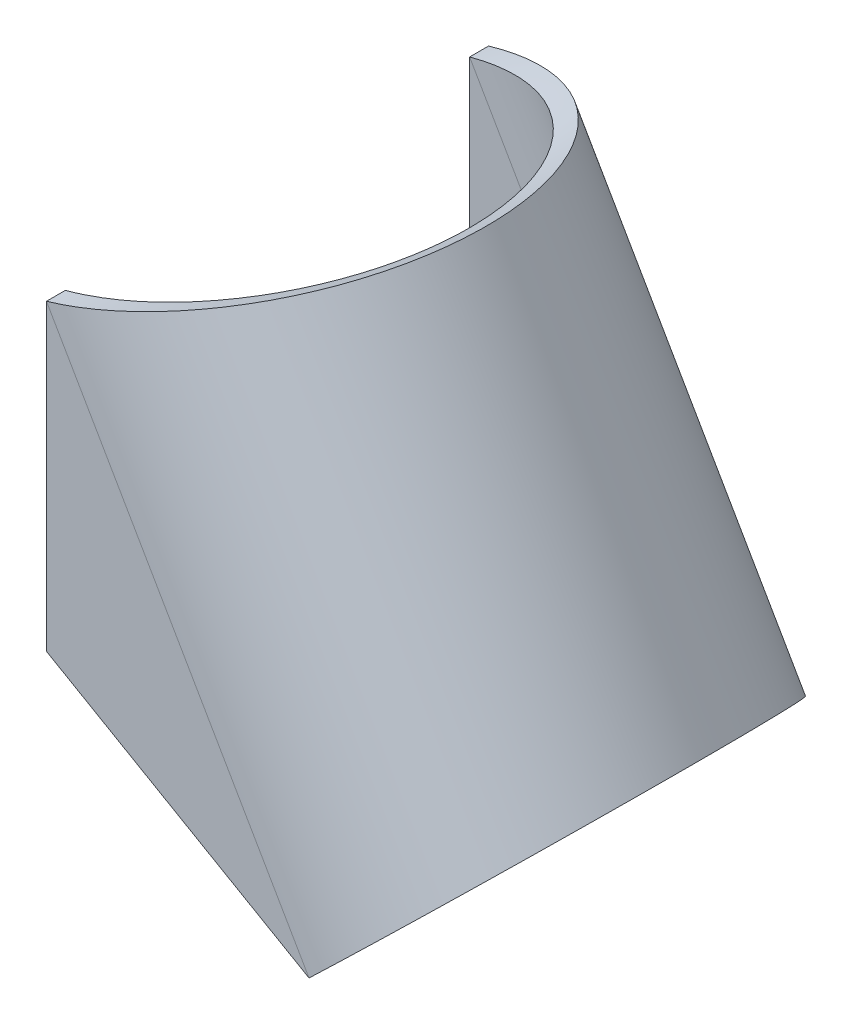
ISO-10303-21;
HEADER;
FILE_DESCRIPTION(('STEP AP214'),'2;1');
FILE_NAME('part.step','',(''),(''),'','','');
FILE_SCHEMA(('AUTOMOTIVE_DESIGN { 1 0 10303 214 1 1 1 1 }'));
ENDSEC;
DATA;
#1=APPLICATION_CONTEXT('core data for automotive mechanical design processes');
#2=APPLICATION_PROTOCOL_DEFINITION('international standard','automotive_design',2000,#1);
#3=PRODUCT_CONTEXT('',#1,'mechanical');
#4=PRODUCT('Part','Part','',(#3));
#5=PRODUCT_RELATED_PRODUCT_CATEGORY('part','',(#4));
#6=PRODUCT_DEFINITION_FORMATION('','',#4);
#7=PRODUCT_DEFINITION_CONTEXT('part definition',#1,'design');
#8=PRODUCT_DEFINITION('design','',#6,#7);
#9=PRODUCT_DEFINITION_SHAPE('','',#8);
#10=(LENGTH_UNIT() NAMED_UNIT(*) SI_UNIT(.MILLI.,.METRE.));
#11=(NAMED_UNIT(*) PLANE_ANGLE_UNIT() SI_UNIT($,.RADIAN.));
#12=(NAMED_UNIT(*) SI_UNIT($,.STERADIAN.) SOLID_ANGLE_UNIT());
#13=UNCERTAINTY_MEASURE_WITH_UNIT(LENGTH_MEASURE(1.E-05),#10,'distance_accuracy_value','');
#14=(GEOMETRIC_REPRESENTATION_CONTEXT(3) GLOBAL_UNCERTAINTY_ASSIGNED_CONTEXT((#13)) GLOBAL_UNIT_ASSIGNED_CONTEXT((#10,
#11,#12)) REPRESENTATION_CONTEXT('',''));
#15=CARTESIAN_POINT('',(0.,0.,0.));
#16=DIRECTION('',(0.,0.,1.));
#17=DIRECTION('',(1.,0.,0.));
#18=AXIS2_PLACEMENT_3D('',#15,#16,#17);
#19=CARTESIAN_POINT('',(13.8564064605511,-7.99999999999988,-44.7597963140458));
#20=DIRECTION('',(-0.499999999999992,-0.866025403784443,0.));
#21=DIRECTION('',(-0.866025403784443,0.499999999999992,0.));
#22=AXIS2_PLACEMENT_3D('',#19,#20,#21);
#23=PLANE('',#22);
#24=DIRECTION('',(0.866025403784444,-0.499999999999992,0.));
#25=VECTOR('',#24,1.);
#26=CARTESIAN_POINT('',(13.8564064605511,-7.99999999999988,11.6658295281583));
#27=LINE('',#26,#25);
#28=CARTESIAN_POINT('',(0.,0.,11.6658295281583));
#29=VERTEX_POINT('',#28);
#30=CARTESIAN_POINT('',(13.8564064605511,-7.99999999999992,11.6658295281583));
#31=VERTEX_POINT('',#30);
#32=EDGE_CURVE('E287',#29,#31,#27,.T.);
#33=ORIENTED_EDGE('',*,*,#32,.F.);
#34=DIRECTION('',(0.,0.,1.));
#35=VECTOR('',#34,1.);
#36=CARTESIAN_POINT('',(0.,0.,-44.7597963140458));
#37=LINE('',#36,#35);
#38=CARTESIAN_POINT('',(0.,0.,10.6658295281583));
#39=VERTEX_POINT('',#38);
#40=EDGE_CURVE('E13',#39,#29,#37,.T.);
#41=ORIENTED_EDGE('',*,*,#40,.F.);
#42=DIRECTION('',(0.866025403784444,-0.499999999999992,0.));
#43=VECTOR('',#42,1.);
#44=CARTESIAN_POINT('',(13.8564064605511,-7.99999999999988,10.6658295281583));
#45=LINE('',#44,#43);
#46=CARTESIAN_POINT('',(13.8564064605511,-7.99999999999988,10.6658295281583));
#47=VERTEX_POINT('',#46);
#48=EDGE_CURVE('E284',#39,#47,#45,.T.);
#49=ORIENTED_EDGE('',*,*,#48,.T.);
#50=CARTESIAN_POINT('',(13.8564064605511,-7.99999999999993,11.6658295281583));
#51=CARTESIAN_POINT('',(13.8564064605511,-7.99999999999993,10.6658295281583));
#52=B_SPLINE_CURVE_WITH_KNOTS('',1,(#50,#51),.UNSPECIFIED.,.F.,.F.,(2,2),(0.,1.),.UNSPECIFIED.);
#53=EDGE_CURVE('E293',#47,#31,#52,.F.);
#54=ORIENTED_EDGE('',*,*,#53,.T.);
#55=EDGE_LOOP('',(#33,#41,#49,#54));
#56=FACE_BOUND('',#55,.T.);
#57=ADVANCED_FACE('F37',(#56),#23,.T.);
#58=CARTESIAN_POINT('',(13.8564064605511,-7.99999999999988,11.6658295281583));
#59=DIRECTION('',(0.,0.,-1.));
#60=DIRECTION('',(0.499999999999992,0.866025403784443,0.));
#61=AXIS2_PLACEMENT_3D('',#58,#59,#60);
#62=PLANE('',#61);
#63=DIRECTION('',(0.500000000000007,-0.866025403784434,0.));
#64=VECTOR('',#63,1.);
#65=CARTESIAN_POINT('',(-1.04083408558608E-13,16.,11.6658295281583));
#66=LINE('',#65,#64);
#67=CARTESIAN_POINT('',(-1.80411241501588E-13,16.,11.6658295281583));
#68=VERTEX_POINT('',#67);
#69=EDGE_CURVE('E75',#68,#31,#66,.T.);
#70=ORIENTED_EDGE('',*,*,#69,.F.);
#71=DIRECTION('',(0.,-1.,0.));
#72=VECTOR('',#71,1.);
#73=CARTESIAN_POINT('',(0.,0.,11.6658295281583));
#74=LINE('',#73,#72);
#75=EDGE_CURVE('E289',#68,#29,#74,.T.);
#76=ORIENTED_EDGE('',*,*,#75,.T.);
#77=ORIENTED_EDGE('',*,*,#32,.T.);
#78=EDGE_LOOP('',(#70,#76,#77));
#79=FACE_BOUND('',#78,.T.);
#80=ADVANCED_FACE('F309',(#79),#62,.F.);
#81=CARTESIAN_POINT('',(0.,0.,-44.7597963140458));
#82=DIRECTION('',(-1.,0.,0.));
#83=DIRECTION('',(0.,1.,0.));
#84=AXIS2_PLACEMENT_3D('',#81,#82,#83);
#85=PLANE('',#84);
#86=ORIENTED_EDGE('',*,*,#75,.F.);
#87=CARTESIAN_POINT('',(-1.64127981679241E-13,16.,10.6658295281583));
#88=CARTESIAN_POINT('',(-1.70633705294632E-13,15.9999999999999,11.6658295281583));
#89=B_SPLINE_CURVE_WITH_KNOTS('',1,(#87,#88),.UNSPECIFIED.,.F.,.F.,(2,2),(0.,1.),.UNSPECIFIED.);
#90=CARTESIAN_POINT('',(-1.04083408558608E-13,16.,10.6658295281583));
#91=VERTEX_POINT('',#90);
#92=EDGE_CURVE('E238',#91,#68,#89,.T.);
#93=ORIENTED_EDGE('',*,*,#92,.F.);
#94=DIRECTION('',(0.,-1.,0.));
#95=VECTOR('',#94,1.);
#96=CARTESIAN_POINT('',(0.,0.,10.6658295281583));
#97=LINE('',#96,#95);
#98=EDGE_CURVE('E49',#91,#39,#97,.T.);
#99=ORIENTED_EDGE('',*,*,#98,.T.);
#100=ORIENTED_EDGE('',*,*,#40,.T.);
#101=EDGE_LOOP('',(#86,#93,#99,#100));
#102=FACE_BOUND('',#101,.T.);
#103=ADVANCED_FACE('F301',(#102),#85,.T.);
#104=CARTESIAN_POINT('',(13.8564064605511,-7.99999999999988,10.6658295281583));
#105=DIRECTION('',(0.,0.,-1.));
#106=DIRECTION('',(0.499999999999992,0.866025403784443,0.));
#107=AXIS2_PLACEMENT_3D('',#104,#105,#106);
#108=PLANE('',#107);
#109=DIRECTION('',(-0.500000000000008,0.866025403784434,0.));
#110=VECTOR('',#109,1.);
#111=CARTESIAN_POINT('',(13.8564064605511,-7.99999999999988,10.6658295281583));
#112=LINE('',#111,#110);
#113=EDGE_CURVE('E237',#47,#91,#112,.T.);
#114=ORIENTED_EDGE('',*,*,#113,.F.);
#115=ORIENTED_EDGE('',*,*,#48,.F.);
#116=ORIENTED_EDGE('',*,*,#98,.F.);
#117=EDGE_LOOP('',(#114,#115,#116));
#118=FACE_BOUND('',#117,.T.);
#119=ADVANCED_FACE('F39',(#118),#108,.T.);
#120=CARTESIAN_POINT('',(13.8564064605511,-7.99999999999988,-11.6658295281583));
#121=DIRECTION('',(0.,0.,1.));
#122=DIRECTION('',(0.499999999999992,0.866025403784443,0.));
#123=AXIS2_PLACEMENT_3D('',#120,#121,#122);
#124=PLANE('',#123);
#125=DIRECTION('',(0.500000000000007,-0.866025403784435,0.));
#126=VECTOR('',#125,1.);
#127=CARTESIAN_POINT('',(-1.0842021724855E-13,16.,-11.6658295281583));
#128=LINE('',#127,#126);
#129=CARTESIAN_POINT('',(-1.04950770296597E-13,16.,-11.6658295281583));
#130=VERTEX_POINT('',#129);
#131=CARTESIAN_POINT('',(13.8564064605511,-7.99999999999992,-11.6658295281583));
#132=VERTEX_POINT('',#131);
#133=EDGE_CURVE('E105',#130,#132,#128,.T.);
#134=ORIENTED_EDGE('',*,*,#133,.T.);
#135=DIRECTION('',(0.866025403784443,-0.499999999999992,0.));
#136=VECTOR('',#135,1.);
#137=CARTESIAN_POINT('',(13.8564064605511,-7.99999999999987,-11.6658295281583));
#138=LINE('',#137,#136);
#139=CARTESIAN_POINT('',(0.,0.,-11.6658295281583));
#140=VERTEX_POINT('',#139);
#141=EDGE_CURVE('E108',#140,#132,#138,.T.);
#142=ORIENTED_EDGE('',*,*,#141,.F.);
#143=DIRECTION('',(0.,-1.,0.));
#144=VECTOR('',#143,1.);
#145=CARTESIAN_POINT('',(0.,0.,-11.6658295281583));
#146=LINE('',#145,#144);
#147=EDGE_CURVE('E110',#130,#140,#146,.T.);
#148=ORIENTED_EDGE('',*,*,#147,.F.);
#149=EDGE_LOOP('',(#134,#142,#148));
#150=FACE_BOUND('',#149,.T.);
#151=ADVANCED_FACE('F107',(#150),#124,.F.);
#152=CARTESIAN_POINT('',(0.,0.,44.7597963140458));
#153=DIRECTION('',(1.,0.,0.));
#154=DIRECTION('',(0.,1.,0.));
#155=AXIS2_PLACEMENT_3D('',#152,#153,#154);
#156=PLANE('',#155);
#157=CARTESIAN_POINT('',(-1.11891762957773E-13,16.,-11.6658295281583));
#158=CARTESIAN_POINT('',(-1.10590618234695E-13,16.,-10.6658295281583));
#159=B_SPLINE_CURVE_WITH_KNOTS('',1,(#157,#158),.UNSPECIFIED.,.F.,.F.,(2,2),(0.,1.),.UNSPECIFIED.);
#160=CARTESIAN_POINT('',(-1.14491749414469E-13,16.,-10.6658295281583));
#161=VERTEX_POINT('',#160);
#162=EDGE_CURVE('E228',#161,#130,#159,.F.);
#163=ORIENTED_EDGE('',*,*,#162,.T.);
#164=ORIENTED_EDGE('',*,*,#147,.T.);
#165=DIRECTION('',(0.,0.,-1.));
#166=VECTOR('',#165,1.);
#167=CARTESIAN_POINT('',(0.,0.,44.7597963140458));
#168=LINE('',#167,#166);
#169=CARTESIAN_POINT('',(0.,0.,-10.6658295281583));
#170=VERTEX_POINT('',#169);
#171=EDGE_CURVE('E121',#170,#140,#168,.T.);
#172=ORIENTED_EDGE('',*,*,#171,.F.);
#173=DIRECTION('',(0.,-1.,0.));
#174=VECTOR('',#173,1.);
#175=CARTESIAN_POINT('',(0.,0.,-10.6658295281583));
#176=LINE('',#175,#174);
#177=EDGE_CURVE('E82',#161,#170,#176,.T.);
#178=ORIENTED_EDGE('',*,*,#177,.F.);
#179=EDGE_LOOP('',(#163,#164,#172,#178));
#180=FACE_BOUND('',#179,.T.);
#181=ADVANCED_FACE('F264',(#180),#156,.F.);
#182=CARTESIAN_POINT('',(13.8564064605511,-7.99999999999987,44.7597963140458));
#183=DIRECTION('',(0.499999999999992,0.866025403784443,0.));
#184=DIRECTION('',(-0.866025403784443,0.499999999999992,0.));
#185=AXIS2_PLACEMENT_3D('',#182,#183,#184);
#186=PLANE('',#185);
#187=ORIENTED_EDGE('',*,*,#171,.T.);
#188=ORIENTED_EDGE('',*,*,#141,.T.);
#189=CARTESIAN_POINT('',(13.8564064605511,-7.99999999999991,-10.6658295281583));
#190=CARTESIAN_POINT('',(13.8564064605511,-7.99999999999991,-11.6658295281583));
#191=B_SPLINE_CURVE_WITH_KNOTS('',1,(#189,#190),.UNSPECIFIED.,.F.,.F.,(2,2),(0.,1.),.UNSPECIFIED.);
#192=CARTESIAN_POINT('',(13.8564064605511,-7.99999999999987,-10.6658295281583));
#193=VERTEX_POINT('',#192);
#194=EDGE_CURVE('E119',#193,#132,#191,.T.);
#195=ORIENTED_EDGE('',*,*,#194,.F.);
#196=DIRECTION('',(0.866025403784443,-0.499999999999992,0.));
#197=VECTOR('',#196,1.);
#198=CARTESIAN_POINT('',(13.8564064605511,-7.99999999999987,-10.6658295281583));
#199=LINE('',#198,#197);
#200=EDGE_CURVE('E90',#170,#193,#199,.T.);
#201=ORIENTED_EDGE('',*,*,#200,.F.);
#202=EDGE_LOOP('',(#187,#188,#195,#201));
#203=FACE_BOUND('',#202,.T.);
#204=ADVANCED_FACE('F118',(#203),#186,.F.);
#205=CARTESIAN_POINT('',(13.8564064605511,-7.99999999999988,-10.6658295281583));
#206=DIRECTION('',(0.,0.,1.));
#207=DIRECTION('',(0.499999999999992,0.866025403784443,0.));
#208=AXIS2_PLACEMENT_3D('',#205,#206,#207);
#209=PLANE('',#208);
#210=DIRECTION('',(-0.500000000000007,0.866025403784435,0.));
#211=VECTOR('',#210,1.);
#212=CARTESIAN_POINT('',(13.8564064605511,-7.99999999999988,-10.6658295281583));
#213=LINE('',#212,#211);
#214=EDGE_CURVE('E280',#161,#193,#213,.F.);
#215=ORIENTED_EDGE('',*,*,#214,.F.);
#216=ORIENTED_EDGE('',*,*,#177,.T.);
#217=ORIENTED_EDGE('',*,*,#200,.T.);
#218=EDGE_LOOP('',(#215,#216,#217));
#219=FACE_BOUND('',#218,.T.);
#220=ADVANCED_FACE('F202',(#219),#209,.T.);
#221=CARTESIAN_POINT('',(-1.70633705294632E-13,15.9999999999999,11.6658295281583));
#222=CARTESIAN_POINT('',(0.486657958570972,16.1417099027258,11.6658295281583));
#223=CARTESIAN_POINT('',(0.914898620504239,16.2666069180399,11.6351073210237));
#224=CARTESIAN_POINT('',(1.46808695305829,16.427685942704,11.5724182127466));
#225=CARTESIAN_POINT('',(1.63764938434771,16.4770261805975,11.5486732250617));
#226=CARTESIAN_POINT('',(1.86985954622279,16.5445749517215,11.5117150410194));
#227=CARTESIAN_POINT('',(1.94357585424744,16.5660153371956,11.4991668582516));
#228=CARTESIAN_POINT('',(2.04864702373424,16.5965778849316,11.4803198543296));
#229=CARTESIAN_POINT('',(2.08275359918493,16.6064991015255,11.4740330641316));
#230=CARTESIAN_POINT('',(2.13254165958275,16.620983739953,11.4646330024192));
#231=CARTESIAN_POINT('',(2.14890904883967,16.6257457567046,11.461504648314));
#232=CARTESIAN_POINT('',(2.17311769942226,16.6327897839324,11.4568240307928));
#233=CARTESIAN_POINT('',(2.18113017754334,16.6351212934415,11.4552658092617));
#234=CARTESIAN_POINT('',(2.19306335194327,16.6385938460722,11.4529319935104));
#235=CARTESIAN_POINT('',(2.19702681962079,16.6397472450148,11.4521546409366));
#236=CARTESIAN_POINT('',(2.20295064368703,16.6414711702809,11.4509895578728));
#237=CARTESIAN_POINT('',(2.20492168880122,16.6420447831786,11.4506013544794));
#238=CARTESIAN_POINT('',(2.20787291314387,16.642903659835,11.4500192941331));
#239=CARTESIAN_POINT('',(2.20885576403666,16.6431896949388,11.449825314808));
#240=CARTESIAN_POINT('',(2.2108196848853,16.6437612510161,11.4494374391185));
#241=CARTESIAN_POINT('',(2.21122135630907,16.6438781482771,11.4493581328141));
#242=CARTESIAN_POINT('',(2.6120329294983,16.7605272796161,11.3700879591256));
#243=CARTESIAN_POINT('',(2.98995385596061,16.8706350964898,11.273173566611));
#244=CARTESIAN_POINT('',(3.52396552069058,17.0261615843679,11.1093789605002));
#245=CARTESIAN_POINT('',(3.69650477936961,17.0764057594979,11.0517021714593));
#246=CARTESIAN_POINT('',(3.94711659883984,17.1493749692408,10.9615531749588));
#247=CARTESIAN_POINT('',(4.0292883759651,17.1732989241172,10.9308972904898));
#248=CARTESIAN_POINT('',(4.15050350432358,17.2085894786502,10.8841217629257));
#249=CARTESIAN_POINT('',(4.19056816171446,17.2202537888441,10.8683979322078));
#250=CARTESIAN_POINT('',(4.2501556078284,17.2376020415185,10.8446285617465));
#251=CARTESIAN_POINT('',(4.26993316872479,17.24336009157,10.8366748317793));
#252=CARTESIAN_POINT('',(4.29947227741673,17.251960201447,10.8247001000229));
#253=CARTESIAN_POINT('',(4.30929744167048,17.2548207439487,10.8207011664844));
#254=CARTESIAN_POINT('',(4.32400339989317,17.2591023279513,10.8146919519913));
#255=CARTESIAN_POINT('',(4.32890008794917,17.2605279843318,10.8126870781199));
#256=CARTESIAN_POINT('',(4.33623717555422,17.2626641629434,10.8096770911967));
#257=CARTESIAN_POINT('',(4.33868154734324,17.2633758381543,10.8086733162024));
#258=CARTESIAN_POINT('',(4.34356764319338,17.2647984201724,10.8066648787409));
#259=CARTESIAN_POINT('',(4.34547106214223,17.265352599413,10.8058819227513));
#260=CARTESIAN_POINT('',(5.11099838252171,17.4882359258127,10.4905916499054));
#261=CARTESIAN_POINT('',(5.80522018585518,17.690860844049,10.1082076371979));
#262=CARTESIAN_POINT('',(6.73889856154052,17.9627299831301,9.47407707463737));
#263=CARTESIAN_POINT('',(7.03230573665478,18.0480795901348,9.25255863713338));
#264=CARTESIAN_POINT('',(7.44599917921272,18.168373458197,8.90976186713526));
#265=CARTESIAN_POINT('',(7.57949991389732,18.2071863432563,8.79373874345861));
#266=CARTESIAN_POINT('',(7.77324187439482,18.2635279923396,8.61761341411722));
#267=CARTESIAN_POINT('',(7.8367379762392,18.2819957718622,8.55855623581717));
#268=CARTESIAN_POINT('',(7.93036871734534,18.3092360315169,8.46951288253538));
#269=CARTESIAN_POINT('',(7.96131007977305,18.3182392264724,8.43975548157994));
#270=CARTESIAN_POINT('',(8.00732062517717,18.3316297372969,8.39501297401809));
#271=CARTESIAN_POINT('',(8.02259055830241,18.336074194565,8.38008106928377));
#272=CARTESIAN_POINT('',(8.04539532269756,18.3427124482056,8.35765760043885));
#273=CARTESIAN_POINT('',(8.05298022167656,18.3449204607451,8.35017884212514));
#274=CARTESIAN_POINT('',(8.0643325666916,18.348225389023,8.3389544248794));
#275=CARTESIAN_POINT('',(8.06811251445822,18.3493258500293,8.33521190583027));
#276=CARTESIAN_POINT('',(8.07566408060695,18.3515244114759,8.32772479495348));
#277=CARTESIAN_POINT('',(8.07878258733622,18.3524323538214,8.32462952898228));
#278=CARTESIAN_POINT('',(8.64903584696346,18.5184656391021,7.75768177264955));
#279=CARTESIAN_POINT('',(9.14485236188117,18.6631089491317,7.14818810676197));
#280=CARTESIAN_POINT('',(9.78063181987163,18.8482331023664,6.19194193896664));
#281=CARTESIAN_POINT('',(9.97463401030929,18.90467279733,5.86617086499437));
#282=CARTESIAN_POINT('',(10.2389301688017,18.9815333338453,5.37028064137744));
#283=CARTESIAN_POINT('',(10.3225811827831,19.0058556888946,5.20377624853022));
#284=CARTESIAN_POINT('',(10.4414381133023,19.0404224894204,4.95260085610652));
#285=CARTESIAN_POINT('',(10.4799540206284,19.0516254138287,4.86863911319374));
#286=CARTESIAN_POINT('',(10.5360814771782,19.0679555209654,4.74238932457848));
#287=CARTESIAN_POINT('',(10.5545162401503,19.0733198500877,4.70025485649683));
#288=CARTESIAN_POINT('',(10.5817579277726,19.0812484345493,4.63698222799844));
#289=CARTESIAN_POINT('',(10.5907700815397,19.0838716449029,4.61587953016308));
#290=CARTESIAN_POINT('',(10.6041858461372,19.0877770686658,4.58420848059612));
#291=CARTESIAN_POINT('',(10.6086406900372,19.0890739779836,4.57364863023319));
#292=CARTESIAN_POINT('',(10.6175162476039,19.0916580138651,4.55252338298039));
#293=CARTESIAN_POINT('',(10.6216247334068,19.0928542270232,4.54270728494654));
#294=CARTESIAN_POINT('',(10.9281575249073,19.1821093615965,3.80707572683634));
#295=CARTESIAN_POINT('',(11.1552317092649,19.2484308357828,3.05671947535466));
#296=CARTESIAN_POINT('',(11.4570678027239,19.3363206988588,1.53582523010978));
#297=CARTESIAN_POINT('',(11.5318465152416,19.3578987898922,0.765494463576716));
#298=CARTESIAN_POINT('',(11.5318633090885,19.3579020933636,-0.76524760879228));
#299=CARTESIAN_POINT('',(11.4570730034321,19.3363117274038,-1.5358259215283));
#300=CARTESIAN_POINT('',(11.2306984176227,19.270388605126,-2.67649897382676));
#301=CARTESIAN_POINT('',(11.1362497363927,19.2428483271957,-3.05417569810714));
#302=CARTESIAN_POINT('',(10.9662281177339,19.1932682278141,-3.61389620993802));
#303=CARTESIAN_POINT('',(10.9048322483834,19.1753648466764,-3.79933682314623));
#304=CARTESIAN_POINT('',(10.8056979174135,19.1464692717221,-4.07542395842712));
#305=CARTESIAN_POINT('',(10.7714798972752,19.136497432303,-4.167107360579));
#306=CARTESIAN_POINT('',(10.7183999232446,19.1210336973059,-4.30406712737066));
#307=CARTESIAN_POINT('',(10.7004144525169,19.115794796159,-4.34962616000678));
#308=CARTESIAN_POINT('',(10.6729989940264,19.1078105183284,-4.41781751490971));
#309=CARTESIAN_POINT('',(10.66378763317,19.1051281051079,-4.44052343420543));
#310=CARTESIAN_POINT('',(10.6498614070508,19.1010730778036,-4.47454478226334));
#311=CARTESIAN_POINT('',(10.6452011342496,19.0997161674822,-4.48587897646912));
#312=CARTESIAN_POINT('',(10.6358442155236,19.0969918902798,-4.50853473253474));
#313=CARTESIAN_POINT('',(10.6308345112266,19.0955333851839,-4.52060760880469));
#314=CARTESIAN_POINT('',(10.3447199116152,19.0122390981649,-5.2072591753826));
#315=CARTESIAN_POINT('',(9.99288394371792,18.9100693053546,-5.87259771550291));
#316=CARTESIAN_POINT('',(9.3571546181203,18.7249679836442,-6.82888372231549));
#317=CARTESIAN_POINT('',(9.12729912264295,18.6579887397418,-7.14065415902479));
#318=CARTESIAN_POINT('',(8.75575719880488,18.5496939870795,-7.59433114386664));
#319=CARTESIAN_POINT('',(8.62745395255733,18.5122936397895,-7.74322527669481));
#320=CARTESIAN_POINT('',(8.42837143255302,18.4542724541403,-7.96261903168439));
#321=CARTESIAN_POINT('',(8.36090624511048,18.4346120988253,-8.03509229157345));
#322=CARTESIAN_POINT('',(8.25806137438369,18.404647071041,-8.14275823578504));
#323=CARTESIAN_POINT('',(8.22350525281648,18.3945796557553,-8.17847288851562));
#324=CARTESIAN_POINT('',(8.17126065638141,18.3793606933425,-8.23177671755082));
#325=CARTESIAN_POINT('',(8.15377738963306,18.3742680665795,-8.24949996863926));
#326=CARTESIAN_POINT('',(8.12745006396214,18.3665997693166,-8.27601691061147));
#327=CARTESIAN_POINT('',(8.11865721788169,18.364038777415,-8.28484456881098));
#328=CARTESIAN_POINT('',(8.10544236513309,18.3601899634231,-8.29806896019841));
#329=CARTESIAN_POINT('',(8.10103315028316,18.358905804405,-8.30247424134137));
#330=CARTESIAN_POINT('',(8.0922061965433,18.3563350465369,-8.31127908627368));
#331=CARTESIAN_POINT('',(8.08712755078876,18.3548559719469,-8.31633577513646));
#332=CARTESIAN_POINT('',(7.6019466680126,18.2135568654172,-8.79874039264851));
#333=CARTESIAN_POINT('',(7.05162347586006,18.0537619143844,-9.26154524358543));
#334=CARTESIAN_POINT('',(6.11800699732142,17.781924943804,-9.89584816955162));
#335=CARTESIAN_POINT('',(5.78885795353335,17.6860004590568,-10.0972200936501));
#336=CARTESIAN_POINT('',(5.26848392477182,17.5342984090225,-10.3790434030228));
#337=CARTESIAN_POINT('',(5.09059100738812,17.4824324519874,-10.4696081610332));
#338=CARTESIAN_POINT('',(4.81719888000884,17.4027431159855,-10.599716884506));
#339=CARTESIAN_POINT('',(4.72497653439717,17.3758652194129,-10.6421298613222));
#340=CARTESIAN_POINT('',(4.58502256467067,17.3350860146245,-10.7042285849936));
#341=CARTESIAN_POINT('',(4.53810119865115,17.3214159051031,-10.7246746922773));
#342=CARTESIAN_POINT('',(4.46731650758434,17.3007965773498,-10.7549528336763));
#343=CARTESIAN_POINT('',(4.44365450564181,17.2939044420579,-10.7649803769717));
#344=CARTESIAN_POINT('',(4.40806116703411,17.2835378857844,-10.7799225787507));
#345=CARTESIAN_POINT('',(4.39617999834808,17.280077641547,-10.784886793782));
#346=CARTESIAN_POINT('',(4.37833320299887,17.2748802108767,-10.7923081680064));
#347=CARTESIAN_POINT('',(4.3723800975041,17.2731465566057,-10.7947778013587));
#348=CARTESIAN_POINT('',(4.363444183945,17.2705443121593,-10.7984759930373));
#349=CARTESIAN_POINT('',(4.36046450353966,17.2696766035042,-10.7997076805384));
#350=CARTESIAN_POINT('',(4.35450305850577,17.2679405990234,-10.8021689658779));
#351=CARTESIAN_POINT('',(4.35096477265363,17.2669102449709,-10.8036277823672));
#352=CARTESIAN_POINT('',(4.03797399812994,17.1757677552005,-10.9325416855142));
#353=CARTESIAN_POINT('',(3.70481554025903,17.0787872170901,-11.0538130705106));
#354=CARTESIAN_POINT('',(3.17081694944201,16.9232859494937,-11.2177522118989));
#355=CARTESIAN_POINT('',(2.98711713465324,16.8697861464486,-11.269393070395));
#356=CARTESIAN_POINT('',(2.70307462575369,16.7870706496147,-11.3412529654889));
#357=CARTESIAN_POINT('',(2.60697912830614,16.7590883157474,-11.3642720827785));
#358=CARTESIAN_POINT('',(2.46072881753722,16.7165076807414,-11.3972575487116));
#359=CARTESIAN_POINT('',(2.41162759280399,16.7022129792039,-11.4079954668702));
#360=CARTESIAN_POINT('',(2.33745146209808,16.68062057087,-11.4236984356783));
#361=CARTESIAN_POINT('',(2.31263870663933,16.6733980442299,-11.4288654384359));
#362=CARTESIAN_POINT('',(2.27528883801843,16.6625268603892,-11.4365126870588));
#363=CARTESIAN_POINT('',(2.26281709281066,16.6588969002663,-11.439044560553));
#364=CARTESIAN_POINT('',(2.24407683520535,16.6534426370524,-11.4428162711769));
#365=CARTESIAN_POINT('',(2.23782464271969,16.6516229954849,-11.4440691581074));
#366=CARTESIAN_POINT('',(2.22843819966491,16.6488912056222,-11.4459419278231));
#367=CARTESIAN_POINT('',(2.22530802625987,16.6479802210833,-11.4465650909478));
#368=CARTESIAN_POINT('',(2.22061072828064,16.6466131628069,-11.4474981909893));
#369=CARTESIAN_POINT('',(2.21904462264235,16.6461573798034,-11.4478089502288));
#370=CARTESIAN_POINT('',(2.21591173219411,16.6452456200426,-11.4484299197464));
#371=CARTESIAN_POINT('',(2.21376022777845,16.6446194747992,-11.4488557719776));
#372=CARTESIAN_POINT('',(1.96128221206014,16.571141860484,-11.4987891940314));
#373=CARTESIAN_POINT('',(1.65161905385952,16.4811302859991,-11.5516480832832));
#374=CARTESIAN_POINT('',(0.914030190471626,16.2663545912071,-11.635177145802));
#375=CARTESIAN_POINT('',(0.48607711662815,16.1415406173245,-11.6658295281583));
#376=CARTESIAN_POINT('',(-1.11891762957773E-13,16.,-11.6658295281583));
#377=CARTESIAN_POINT('',(-1.64127981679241E-13,16.,10.6658295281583));
#378=CARTESIAN_POINT('',(0.450109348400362,16.1206089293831,10.6658295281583));
#379=CARTESIAN_POINT('',(0.846183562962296,16.2269342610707,10.6377408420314));
#380=CARTESIAN_POINT('',(1.35782829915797,16.3640280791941,10.5804254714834));
#381=CARTESIAN_POINT('',(1.51465809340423,16.4060171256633,10.558715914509));
#382=CARTESIAN_POINT('',(1.72943211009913,16.4634991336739,10.5249258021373));
#383=CARTESIAN_POINT('',(1.79761334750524,16.4817438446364,10.5134532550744));
#384=CARTESIAN_POINT('',(1.89479503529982,16.5077513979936,10.4962218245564));
#385=CARTESIAN_POINT('',(1.92634063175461,16.5161940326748,10.4904739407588));
#386=CARTESIAN_POINT('',(1.97239016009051,16.52852022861,10.4818796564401));
#387=CARTESIAN_POINT('',(1.98752852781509,16.532572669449,10.4790194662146));
#388=CARTESIAN_POINT('',(2.00991933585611,16.5385671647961,10.4747400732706));
#389=CARTESIAN_POINT('',(2.01733014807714,16.5405513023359,10.4733154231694));
#390=CARTESIAN_POINT('',(2.02836724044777,16.5435065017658,10.4711816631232));
#391=CARTESIAN_POINT('',(2.03203308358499,16.5444880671,10.4704709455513));
#392=CARTESIAN_POINT('',(2.03751207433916,16.5459551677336,10.4694057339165));
#393=CARTESIAN_POINT('',(2.03933510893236,16.5464433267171,10.4690508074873));
#394=CARTESIAN_POINT('',(2.04206471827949,16.5471742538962,10.4685186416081));
#395=CARTESIAN_POINT('',(2.04297376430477,16.5474176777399,10.4683412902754));
#396=CARTESIAN_POINT('',(2.04479020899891,16.5479040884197,10.4679866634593));
#397=CARTESIAN_POINT('',(2.04516171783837,16.5480035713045,10.467914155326));
#398=CARTESIAN_POINT('',(2.41587519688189,16.6472755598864,10.3954390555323));
#399=CARTESIAN_POINT('',(2.7654124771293,16.7409960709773,10.3068322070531));
#400=CARTESIAN_POINT('',(3.25931951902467,16.8733681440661,10.1570781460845));
#401=CARTESIAN_POINT('',(3.41890120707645,16.9161312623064,10.1043454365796));
#402=CARTESIAN_POINT('',(3.65069263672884,16.9782345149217,10.0219240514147));
#403=CARTESIAN_POINT('',(3.72669355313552,16.9985957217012,9.99389600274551));
#404=CARTESIAN_POINT('',(3.83880580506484,17.0286307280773,9.95113009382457));
#405=CARTESIAN_POINT('',(3.87586173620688,17.0385579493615,9.93675411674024));
#406=CARTESIAN_POINT('',(3.93097435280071,17.053322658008,9.9150222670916));
#407=CARTESIAN_POINT('',(3.94926668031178,17.0582232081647,9.90775033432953));
#408=CARTESIAN_POINT('',(3.97658749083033,17.0655425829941,9.89680208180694));
#409=CARTESIAN_POINT('',(3.98567481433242,17.0679771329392,9.89314593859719));
#410=CARTESIAN_POINT('',(3.9992763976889,17.0716211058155,9.88765183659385));
#411=CARTESIAN_POINT('',(4.00380535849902,17.0728344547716,9.8858188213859));
#412=CARTESIAN_POINT('',(4.01059145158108,17.074652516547,9.88306685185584));
#413=CARTESIAN_POINT('',(4.01285225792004,17.075258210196,9.88214912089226));
#414=CARTESIAN_POINT('',(4.01737142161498,17.0764689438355,9.88031284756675));
#415=CARTESIAN_POINT('',(4.01913189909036,17.0769405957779,9.87959700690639));
#416=CARTESIAN_POINT('',(4.72717022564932,17.2666326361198,9.5913335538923));
#417=CARTESIAN_POINT('',(5.36923924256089,17.4391471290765,9.24172766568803));
#418=CARTESIAN_POINT('',(6.23279988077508,17.6705337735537,8.66195505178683));
#419=CARTESIAN_POINT('',(6.50417580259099,17.7431636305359,8.459425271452));
#420=CARTESIAN_POINT('',(6.88680768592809,17.8455240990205,8.14601319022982));
#421=CARTESIAN_POINT('',(7.01028495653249,17.8785499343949,8.03993561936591));
#422=CARTESIAN_POINT('',(7.18947989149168,17.9264928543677,7.87890783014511));
#423=CARTESIAN_POINT('',(7.24820832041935,17.9422080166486,7.824913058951));
#424=CARTESIAN_POINT('',(7.33480840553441,17.9653891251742,7.74350254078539));
#425=CARTESIAN_POINT('',(7.36342635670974,17.9730508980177,7.71629595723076));
#426=CARTESIAN_POINT('',(7.40598183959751,17.9844466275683,7.67538879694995));
#427=CARTESIAN_POINT('',(7.42010509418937,17.9882290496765,7.66173686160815));
#428=CARTESIAN_POINT('',(7.44119733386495,17.9938785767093,7.64123554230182));
#429=CARTESIAN_POINT('',(7.44821264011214,17.9957577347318,7.6343978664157));
#430=CARTESIAN_POINT('',(7.45871246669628,17.9985704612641,7.62413561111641));
#431=CARTESIAN_POINT('',(7.46220855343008,17.9995070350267,7.62071390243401));
#432=CARTESIAN_POINT('',(7.4691930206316,18.0013781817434,7.61386858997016));
#433=CARTESIAN_POINT('',(7.47207733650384,18.0021509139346,7.61103865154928));
#434=CARTESIAN_POINT('',(7.99950599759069,18.14345940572,7.09268990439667));
#435=CARTESIAN_POINT('',(8.45807743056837,18.2665992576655,6.53544230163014));
#436=CARTESIAN_POINT('',(9.04611097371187,18.4241572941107,5.66116597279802));
#437=CARTESIAN_POINT('',(9.22554576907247,18.4721864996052,5.3633201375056));
#438=CARTESIAN_POINT('',(9.46999732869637,18.5375897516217,4.90993784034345));
#439=CARTESIAN_POINT('',(9.54736759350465,18.5582859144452,4.75770627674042));
#440=CARTESIAN_POINT('',(9.65730012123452,18.5877002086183,4.52806174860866));
#441=CARTESIAN_POINT('',(9.69292399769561,18.5972334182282,4.45129724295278));
#442=CARTESIAN_POINT('',(9.74483686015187,18.6111302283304,4.33586964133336));
#443=CARTESIAN_POINT('',(9.76188733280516,18.6156953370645,4.29734695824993));
#444=CARTESIAN_POINT('',(9.78708334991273,18.6224428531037,4.23949808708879));
#445=CARTESIAN_POINT('',(9.79541874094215,18.6246753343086,4.22020432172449));
#446=CARTESIAN_POINT('',(9.8078270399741,18.627999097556,4.19124812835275));
#447=CARTESIAN_POINT('',(9.81194734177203,18.6291028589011,4.18159347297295));
#448=CARTESIAN_POINT('',(9.82015637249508,18.63130207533,4.16227909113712));
#449=CARTESIAN_POINT('',(9.82395632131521,18.6323201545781,4.15330443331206));
#450=CARTESIAN_POINT('',(10.1074690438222,18.7082846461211,3.48073153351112));
#451=CARTESIAN_POINT('',(10.31748283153,18.7647562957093,2.79469614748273));
#452=CARTESIAN_POINT('',(10.5966514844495,18.839559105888,1.40417362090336));
#453=CARTESIAN_POINT('',(10.6658217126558,18.8578991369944,0.699875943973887));
#454=CARTESIAN_POINT('',(10.6658373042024,18.8579017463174,-0.69965024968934));
#455=CARTESIAN_POINT('',(10.5966566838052,18.8395501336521,-1.40417425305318));
#456=CARTESIAN_POINT('',(10.3872827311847,18.7834423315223,-2.44706831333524));
#457=CARTESIAN_POINT('',(10.2999284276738,18.7599979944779,-2.79237042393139));
#458=CARTESIAN_POINT('',(10.1426778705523,18.7177912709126,-3.30411144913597));
#459=CARTESIAN_POINT('',(10.0858937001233,18.7025504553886,-3.47365601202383));
#460=CARTESIAN_POINT('',(9.9942052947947,18.6779537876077,-3.72607683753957));
#461=CARTESIAN_POINT('',(9.96255729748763,18.6694657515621,-3.80990109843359));
#462=CARTESIAN_POINT('',(9.91346383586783,18.6563036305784,-3.93512061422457));
#463=CARTESIAN_POINT('',(9.89682911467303,18.651844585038,-3.97677430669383));
#464=CARTESIAN_POINT('',(9.87147256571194,18.6450490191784,-4.03912026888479));
#465=CARTESIAN_POINT('',(9.86295297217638,18.6427659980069,-4.05987982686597));
#466=CARTESIAN_POINT('',(9.85007258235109,18.6393147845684,-4.09098485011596));
#467=CARTESIAN_POINT('',(9.84576228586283,18.6381599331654,-4.10134747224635));
#468=CARTESIAN_POINT('',(9.8371080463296,18.6358413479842,-4.12206116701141));
#469=CARTESIAN_POINT('',(9.83247455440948,18.6346000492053,-4.13309915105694));
#470=CARTESIAN_POINT('',(9.56784607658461,18.5637107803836,-4.7608906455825));
#471=CARTESIAN_POINT('',(9.24242210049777,18.4767899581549,-5.36919607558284));
#472=CARTESIAN_POINT('',(8.65443461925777,18.319252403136,-6.24350882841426));
#473=CARTESIAN_POINT('',(8.44184274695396,18.26224031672,-6.52855416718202));
#474=CARTESIAN_POINT('',(8.09820706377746,18.1700572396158,-6.94334176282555));
#475=CARTESIAN_POINT('',(7.97954070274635,18.1382207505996,-7.07947262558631));
#476=CARTESIAN_POINT('',(7.79541089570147,18.0888325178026,-7.28005985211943));
#477=CARTESIAN_POINT('',(7.7330128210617,18.0720976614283,-7.3463206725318));
#478=CARTESIAN_POINT('',(7.63789212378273,18.0465921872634,-7.44475744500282));
#479=CARTESIAN_POINT('',(7.60593130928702,18.0380231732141,-7.47741062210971));
#480=CARTESIAN_POINT('',(7.55761043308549,18.0250695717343,-7.52614522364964));
#481=CARTESIAN_POINT('',(7.54144019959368,18.0207350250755,-7.5423492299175));
#482=CARTESIAN_POINT('',(7.51709009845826,18.0142082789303,-7.56659312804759));
#483=CARTESIAN_POINT('',(7.50895760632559,18.0120285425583,-7.57466407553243));
#484=CARTESIAN_POINT('',(7.49673520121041,18.0087527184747,-7.58675486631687));
#485=CARTESIAN_POINT('',(7.49265712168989,18.0076597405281,-7.59078252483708));
#486=CARTESIAN_POINT('',(7.48449307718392,18.0054717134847,-7.59883261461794));
#487=CARTESIAN_POINT('',(7.4797958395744,18.0042128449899,-7.60345584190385));
#488=CARTESIAN_POINT('',(7.03105214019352,17.8839507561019,-8.04450852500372));
#489=CARTESIAN_POINT('',(6.52204068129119,17.7480071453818,-8.46764154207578));
#490=CARTESIAN_POINT('',(5.65853676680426,17.5166496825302,-9.04757174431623));
#491=CARTESIAN_POINT('',(5.35410935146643,17.4349982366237,-9.23168197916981));
#492=CARTESIAN_POINT('',(4.87282122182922,17.3058624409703,-9.48934727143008));
#493=CARTESIAN_POINT('',(4.70829026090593,17.2617110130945,-9.57214877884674));
#494=CARTESIAN_POINT('',(4.4554325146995,17.1938772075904,-9.69110452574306));
#495=CARTESIAN_POINT('',(4.37013682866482,17.1709984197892,-9.72988184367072));
#496=CARTESIAN_POINT('',(4.2406941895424,17.1362879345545,-9.78665743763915));
#497=CARTESIAN_POINT('',(4.19729682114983,17.1246524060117,-9.80535089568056));
#498=CARTESIAN_POINT('',(4.13182825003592,17.1071023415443,-9.83303358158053));
#499=CARTESIAN_POINT('',(4.10994330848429,17.1012361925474,-9.842201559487));
#500=CARTESIAN_POINT('',(4.07702306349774,17.0924129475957,-9.85586290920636));
#501=CARTESIAN_POINT('',(4.06603417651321,17.0894678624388,-9.86040158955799));
#502=CARTESIAN_POINT('',(4.04952767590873,17.0850442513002,-9.86718680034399));
#503=CARTESIAN_POINT('',(4.04402164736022,17.0835687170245,-9.86944473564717));
#504=CARTESIAN_POINT('',(4.03575681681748,17.0813539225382,-9.8728259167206));
#505=CARTESIAN_POINT('',(4.03300090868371,17.0806154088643,-9.8739520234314));
#506=CARTESIAN_POINT('',(4.02748716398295,17.0791378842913,-9.87620232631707));
#507=CARTESIAN_POINT('',(4.02421460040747,17.0782609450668,-9.87753609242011));
#508=CARTESIAN_POINT('',(3.73472913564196,17.0006892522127,-9.99539943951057));
#509=CARTESIAN_POINT('',(3.42658927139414,16.9181532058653,-10.1062753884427));
#510=CARTESIAN_POINT('',(2.9326935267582,16.7858053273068,-10.2561615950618));
#511=CARTESIAN_POINT('',(2.76278964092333,16.740270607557,-10.3033757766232));
#512=CARTESIAN_POINT('',(2.500078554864,16.6698708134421,-10.3690758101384));
#513=CARTESIAN_POINT('',(2.41119971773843,16.6460550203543,-10.3901217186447));
#514=CARTESIAN_POINT('',(2.27593239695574,16.6098154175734,-10.4202796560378));
#515=CARTESIAN_POINT('',(2.23051849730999,16.5976495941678,-10.4300971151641));
#516=CARTESIAN_POINT('',(2.16191264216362,16.5792731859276,-10.4444540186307));
#517=CARTESIAN_POINT('',(2.13896319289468,16.5731264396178,-10.4491781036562));
#518=CARTESIAN_POINT('',(2.10441807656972,16.5638745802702,-10.4561698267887));
#519=CARTESIAN_POINT('',(2.09288288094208,16.5607853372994,-10.4584846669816));
#520=CARTESIAN_POINT('',(2.07554989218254,16.5561435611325,-10.4619330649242));
#521=CARTESIAN_POINT('',(2.06976719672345,16.5545949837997,-10.4630785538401));
#522=CARTESIAN_POINT('',(2.06108560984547,16.5522701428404,-10.4647907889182));
#523=CARTESIAN_POINT('',(2.05819049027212,16.5514948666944,-10.4653605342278));
#524=CARTESIAN_POINT('',(2.0538459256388,16.5503314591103,-10.4662136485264));
#525=CARTESIAN_POINT('',(2.05239742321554,16.5499435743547,-10.4664977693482));
#526=CARTESIAN_POINT('',(2.0494997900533,16.5491676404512,-10.4670655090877));
#527=CARTESIAN_POINT('',(2.04750984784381,16.548634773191,-10.4674548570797));
#528=CARTESIAN_POINT('',(1.81399107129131,16.4861032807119,-10.513107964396));
#529=CARTESIAN_POINT('',(1.52757731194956,16.4095147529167,-10.5614357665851));
#530=CARTESIAN_POINT('',(0.845380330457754,16.2267195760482,-10.6378046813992));
#531=CARTESIAN_POINT('',(0.449572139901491,16.1204648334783,-10.6658295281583));
#532=CARTESIAN_POINT('',(-1.10590618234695E-13,16.,-10.6658295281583));
#533=B_SPLINE_SURFACE_WITH_KNOTS('',1,3,((#221,#222,#223,#224,#225,#226,#227,#228,#229,#230,
#231,#232,#233,#234,#235,#236,#237,#238,#239,#240,#241,#242,#243,#244,#245,#246,#247,#248,#249,
#250,#251,#252,#253,#254,#255,#256,#257,#258,#259,#260,#261,#262,#263,#264,#265,#266,#267,#268,
#269,#270,#271,#272,#273,#274,#275,#276,#277,#278,#279,#280,#281,#282,#283,#284,#285,#286,#287,
#288,#289,#290,#291,#292,#293,#294,#295,#296,#297,#298,#299,#300,#301,#302,#303,#304,#305,#306,
#307,#308,#309,#310,#311,#312,#313,#314,#315,#316,#317,#318,#319,#320,#321,#322,#323,#324,#325,
#326,#327,#328,#329,#330,#331,#332,#333,#334,#335,#336,#337,#338,#339,#340,#341,#342,#343,#344,
#345,#346,#347,#348,#349,#350,#351,#352,#353,#354,#355,#356,#357,#358,#359,#360,#361,#362,#363,
#364,#365,#366,#367,#368,#369,#370,#371,#372,#373,#374,#375,#376),(#377,#378,#379,#380,#381,
#382,#383,#384,#385,#386,#387,#388,#389,#390,#391,#392,#393,#394,#395,#396,#397,#398,#399,#400,
#401,#402,#403,#404,#405,#406,#407,#408,#409,#410,#411,#412,#413,#414,#415,#416,#417,#418,#419,
#420,#421,#422,#423,#424,#425,#426,#427,#428,#429,#430,#431,#432,#433,#434,#435,#436,#437,#438,
#439,#440,#441,#442,#443,#444,#445,#446,#447,#448,#449,#450,#451,#452,#453,#454,#455,#456,#457,
#458,#459,#460,#461,#462,#463,#464,#465,#466,#467,#468,#469,#470,#471,#472,#473,#474,#475,#476,
#477,#478,#479,#480,#481,#482,#483,#484,#485,#486,#487,#488,#489,#490,#491,#492,#493,#494,#495,
#496,#497,#498,#499,#500,#501,#502,#503,#504,#505,#506,#507,#508,#509,#510,#511,#512,#513,#514,
#515,#516,#517,#518,#519,#520,#521,#522,#523,#524,#525,#526,#527,#528,#529,#530,#531,#532)),
.UNSPECIFIED.,.F.,.F.,.F.,(2,2),(4,2,2,2,2,2,2,2,2,2,2,2,2,2,2,2,2,2,2,2,2,2,2,2,2,2,2,2,2,2,2,
2,2,2,2,2,2,2,2,2,2,2,2,2,2,2,2,2,2,2,2,2,2,2,2,2,2,2,2,2,2,2,2,2,2,2,2,2,2,2,2,2,2,2,2,2,2,4),
(0.,1.),(0.,0.03125,0.046875,0.0546875,0.05859375,0.060546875,0.0615234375,0.06201171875,
0.062255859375,0.0623779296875,0.0625,0.09375,0.109375,0.1171875,0.12109375,0.123046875,
0.1240234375,0.12451171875,0.124755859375,0.125,0.1875,0.21875,0.234375,0.2421875,0.24609375,
0.248046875,0.2490234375,0.24951171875,0.25,0.3125,0.34375,0.359375,0.3671875,0.37109375,
0.373046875,0.3740234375,0.375,0.4375,0.5,0.5625,0.59375,0.609375,0.6171875,0.62109375,
0.623046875,0.6240234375,0.625,0.6875,0.71875,0.734375,0.7421875,0.74609375,0.748046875,
0.7490234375,0.74951171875,0.75,0.8125,0.84375,0.859375,0.8671875,0.87109375,0.873046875,
0.8740234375,0.87451171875,0.874755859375,0.875,0.90625,0.921875,0.9296875,0.93359375,
0.935546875,0.9365234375,0.93701171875,0.937255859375,0.9373779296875,0.9375,0.96875,1.),.UNSPECIFIED.);
#534=CARTESIAN_POINT('',(-1.10590618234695E-13,16.,-10.6658295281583));
#535=CARTESIAN_POINT('',(0.449572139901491,16.1204648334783,-10.6658295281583));
#536=CARTESIAN_POINT('',(0.845380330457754,16.2267195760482,-10.6378046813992));
#537=CARTESIAN_POINT('',(1.52757731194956,16.4095147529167,-10.5614357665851));
#538=CARTESIAN_POINT('',(1.81399107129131,16.4861032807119,-10.513107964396));
#539=CARTESIAN_POINT('',(2.04750984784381,16.548634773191,-10.4674548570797));
#540=CARTESIAN_POINT('',(2.0494997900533,16.5491676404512,-10.4670655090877));
#541=CARTESIAN_POINT('',(2.05239742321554,16.5499435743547,-10.4664977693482));
#542=CARTESIAN_POINT('',(2.0538459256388,16.5503314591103,-10.4662136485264));
#543=CARTESIAN_POINT('',(2.05819049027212,16.5514948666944,-10.4653605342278));
#544=CARTESIAN_POINT('',(2.06108560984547,16.5522701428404,-10.4647907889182));
#545=CARTESIAN_POINT('',(2.06976719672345,16.5545949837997,-10.4630785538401));
#546=CARTESIAN_POINT('',(2.07554989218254,16.5561435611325,-10.4619330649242));
#547=CARTESIAN_POINT('',(2.09288288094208,16.5607853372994,-10.4584846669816));
#548=CARTESIAN_POINT('',(2.10441807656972,16.5638745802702,-10.4561698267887));
#549=CARTESIAN_POINT('',(2.13896319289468,16.5731264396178,-10.4491781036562));
#550=CARTESIAN_POINT('',(2.16191264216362,16.5792731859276,-10.4444540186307));
#551=CARTESIAN_POINT('',(2.23051849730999,16.5976495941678,-10.4300971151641));
#552=CARTESIAN_POINT('',(2.27593239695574,16.6098154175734,-10.4202796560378));
#553=CARTESIAN_POINT('',(2.41119971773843,16.6460550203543,-10.3901217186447));
#554=CARTESIAN_POINT('',(2.500078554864,16.6698708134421,-10.3690758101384));
#555=CARTESIAN_POINT('',(2.76278964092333,16.740270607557,-10.3033757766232));
#556=CARTESIAN_POINT('',(2.9326935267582,16.7858053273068,-10.2561615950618));
#557=CARTESIAN_POINT('',(3.42658927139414,16.9181532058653,-10.1062753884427));
#558=CARTESIAN_POINT('',(3.73472913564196,17.0006892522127,-9.99539943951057));
#559=CARTESIAN_POINT('',(4.02421460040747,17.0782609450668,-9.87753609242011));
#560=CARTESIAN_POINT('',(4.02748716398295,17.0791378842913,-9.87620232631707));
#561=CARTESIAN_POINT('',(4.03300090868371,17.0806154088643,-9.8739520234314));
#562=CARTESIAN_POINT('',(4.03575681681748,17.0813539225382,-9.8728259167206));
#563=CARTESIAN_POINT('',(4.04402164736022,17.0835687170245,-9.86944473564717));
#564=CARTESIAN_POINT('',(4.04952767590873,17.0850442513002,-9.86718680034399));
#565=CARTESIAN_POINT('',(4.06603417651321,17.0894678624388,-9.86040158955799));
#566=CARTESIAN_POINT('',(4.07702306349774,17.0924129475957,-9.85586290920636));
#567=CARTESIAN_POINT('',(4.10994330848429,17.1012361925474,-9.842201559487));
#568=CARTESIAN_POINT('',(4.13182825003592,17.1071023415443,-9.83303358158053));
#569=CARTESIAN_POINT('',(4.19729682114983,17.1246524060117,-9.80535089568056));
#570=CARTESIAN_POINT('',(4.2406941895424,17.1362879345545,-9.78665743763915));
#571=CARTESIAN_POINT('',(4.37013682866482,17.1709984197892,-9.72988184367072));
#572=CARTESIAN_POINT('',(4.4554325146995,17.1938772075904,-9.69110452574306));
#573=CARTESIAN_POINT('',(4.70829026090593,17.2617110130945,-9.57214877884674));
#574=CARTESIAN_POINT('',(4.87282122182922,17.3058624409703,-9.48934727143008));
#575=CARTESIAN_POINT('',(5.35410935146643,17.4349982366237,-9.23168197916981));
#576=CARTESIAN_POINT('',(5.65853676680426,17.5166496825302,-9.04757174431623));
#577=CARTESIAN_POINT('',(6.52204068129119,17.7480071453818,-8.46764154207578));
#578=CARTESIAN_POINT('',(7.03105214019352,17.8839507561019,-8.04450852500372));
#579=CARTESIAN_POINT('',(7.4797958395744,18.0042128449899,-7.60345584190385));
#580=CARTESIAN_POINT('',(7.48449307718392,18.0054717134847,-7.59883261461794));
#581=CARTESIAN_POINT('',(7.49265712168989,18.0076597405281,-7.59078252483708));
#582=CARTESIAN_POINT('',(7.49673520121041,18.0087527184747,-7.58675486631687));
#583=CARTESIAN_POINT('',(7.50895760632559,18.0120285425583,-7.57466407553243));
#584=CARTESIAN_POINT('',(7.51709009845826,18.0142082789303,-7.56659312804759));
#585=CARTESIAN_POINT('',(7.54144019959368,18.0207350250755,-7.5423492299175));
#586=CARTESIAN_POINT('',(7.55761043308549,18.0250695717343,-7.52614522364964));
#587=CARTESIAN_POINT('',(7.60593130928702,18.0380231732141,-7.47741062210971));
#588=CARTESIAN_POINT('',(7.63789212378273,18.0465921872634,-7.44475744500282));
#589=CARTESIAN_POINT('',(7.7330128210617,18.0720976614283,-7.3463206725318));
#590=CARTESIAN_POINT('',(7.79541089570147,18.0888325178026,-7.28005985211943));
#591=CARTESIAN_POINT('',(7.97954070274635,18.1382207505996,-7.07947262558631));
#592=CARTESIAN_POINT('',(8.09820706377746,18.1700572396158,-6.94334176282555));
#593=CARTESIAN_POINT('',(8.44184274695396,18.26224031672,-6.52855416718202));
#594=CARTESIAN_POINT('',(8.65443461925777,18.319252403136,-6.24350882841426));
#595=CARTESIAN_POINT('',(9.24242210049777,18.4767899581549,-5.36919607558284));
#596=CARTESIAN_POINT('',(9.56784607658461,18.5637107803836,-4.7608906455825));
#597=CARTESIAN_POINT('',(9.83247455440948,18.6346000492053,-4.13309915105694));
#598=CARTESIAN_POINT('',(9.8371080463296,18.6358413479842,-4.12206116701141));
#599=CARTESIAN_POINT('',(9.84576228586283,18.6381599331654,-4.10134747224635));
#600=CARTESIAN_POINT('',(9.85007258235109,18.6393147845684,-4.09098485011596));
#601=CARTESIAN_POINT('',(9.86295297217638,18.6427659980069,-4.05987982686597));
#602=CARTESIAN_POINT('',(9.87147256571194,18.6450490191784,-4.03912026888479));
#603=CARTESIAN_POINT('',(9.89682911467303,18.651844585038,-3.97677430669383));
#604=CARTESIAN_POINT('',(9.91346383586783,18.6563036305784,-3.93512061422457));
#605=CARTESIAN_POINT('',(9.96255729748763,18.6694657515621,-3.80990109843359));
#606=CARTESIAN_POINT('',(9.9942052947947,18.6779537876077,-3.72607683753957));
#607=CARTESIAN_POINT('',(10.0858937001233,18.7025504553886,-3.47365601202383));
#608=CARTESIAN_POINT('',(10.1426778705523,18.7177912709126,-3.30411144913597));
#609=CARTESIAN_POINT('',(10.2999284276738,18.7599979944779,-2.79237042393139));
#610=CARTESIAN_POINT('',(10.3872827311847,18.7834423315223,-2.44706831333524));
#611=CARTESIAN_POINT('',(10.5966566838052,18.8395501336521,-1.40417425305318));
#612=CARTESIAN_POINT('',(10.6658373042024,18.8579017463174,-0.69965024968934));
#613=CARTESIAN_POINT('',(10.6658217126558,18.8578991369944,0.699875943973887));
#614=CARTESIAN_POINT('',(10.5966514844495,18.839559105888,1.40417362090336));
#615=CARTESIAN_POINT('',(10.31748283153,18.7647562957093,2.79469614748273));
#616=CARTESIAN_POINT('',(10.1074690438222,18.7082846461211,3.48073153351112));
#617=CARTESIAN_POINT('',(9.82395632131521,18.6323201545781,4.15330443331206));
#618=CARTESIAN_POINT('',(9.82015637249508,18.63130207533,4.16227909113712));
#619=CARTESIAN_POINT('',(9.81194734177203,18.6291028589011,4.18159347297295));
#620=CARTESIAN_POINT('',(9.8078270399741,18.627999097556,4.19124812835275));
#621=CARTESIAN_POINT('',(9.79541874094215,18.6246753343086,4.22020432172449));
#622=CARTESIAN_POINT('',(9.78708334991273,18.6224428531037,4.23949808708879));
#623=CARTESIAN_POINT('',(9.76188733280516,18.6156953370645,4.29734695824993));
#624=CARTESIAN_POINT('',(9.74483686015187,18.6111302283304,4.33586964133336));
#625=CARTESIAN_POINT('',(9.69292399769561,18.5972334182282,4.45129724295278));
#626=CARTESIAN_POINT('',(9.65730012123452,18.5877002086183,4.52806174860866));
#627=CARTESIAN_POINT('',(9.54736759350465,18.5582859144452,4.75770627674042));
#628=CARTESIAN_POINT('',(9.46999732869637,18.5375897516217,4.90993784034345));
#629=CARTESIAN_POINT('',(9.22554576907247,18.4721864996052,5.3633201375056));
#630=CARTESIAN_POINT('',(9.04611097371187,18.4241572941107,5.66116597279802));
#631=CARTESIAN_POINT('',(8.45807743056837,18.2665992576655,6.53544230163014));
#632=CARTESIAN_POINT('',(7.99950599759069,18.14345940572,7.09268990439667));
#633=CARTESIAN_POINT('',(7.47207733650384,18.0021509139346,7.61103865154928));
#634=CARTESIAN_POINT('',(7.4691930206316,18.0013781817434,7.61386858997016));
#635=CARTESIAN_POINT('',(7.46220855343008,17.9995070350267,7.62071390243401));
#636=CARTESIAN_POINT('',(7.45871246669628,17.9985704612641,7.62413561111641));
#637=CARTESIAN_POINT('',(7.44821264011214,17.9957577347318,7.6343978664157));
#638=CARTESIAN_POINT('',(7.44119733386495,17.9938785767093,7.64123554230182));
#639=CARTESIAN_POINT('',(7.42010509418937,17.9882290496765,7.66173686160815));
#640=CARTESIAN_POINT('',(7.40598183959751,17.9844466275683,7.67538879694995));
#641=CARTESIAN_POINT('',(7.36342635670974,17.9730508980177,7.71629595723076));
#642=CARTESIAN_POINT('',(7.33480840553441,17.9653891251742,7.74350254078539));
#643=CARTESIAN_POINT('',(7.24820832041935,17.9422080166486,7.824913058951));
#644=CARTESIAN_POINT('',(7.18947989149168,17.9264928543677,7.87890783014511));
#645=CARTESIAN_POINT('',(7.01028495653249,17.8785499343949,8.03993561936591));
#646=CARTESIAN_POINT('',(6.88680768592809,17.8455240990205,8.14601319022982));
#647=CARTESIAN_POINT('',(6.50417580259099,17.7431636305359,8.459425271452));
#648=CARTESIAN_POINT('',(6.23279988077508,17.6705337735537,8.66195505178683));
#649=CARTESIAN_POINT('',(5.36923924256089,17.4391471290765,9.24172766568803));
#650=CARTESIAN_POINT('',(4.72717022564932,17.2666326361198,9.5913335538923));
#651=CARTESIAN_POINT('',(4.01913189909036,17.0769405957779,9.87959700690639));
#652=CARTESIAN_POINT('',(4.01737142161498,17.0764689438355,9.88031284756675));
#653=CARTESIAN_POINT('',(4.01285225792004,17.075258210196,9.88214912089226));
#654=CARTESIAN_POINT('',(4.01059145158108,17.074652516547,9.88306685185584));
#655=CARTESIAN_POINT('',(4.00380535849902,17.0728344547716,9.8858188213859));
#656=CARTESIAN_POINT('',(3.9992763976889,17.0716211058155,9.88765183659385));
#657=CARTESIAN_POINT('',(3.98567481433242,17.0679771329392,9.89314593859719));
#658=CARTESIAN_POINT('',(3.97658749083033,17.0655425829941,9.89680208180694));
#659=CARTESIAN_POINT('',(3.94926668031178,17.0582232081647,9.90775033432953));
#660=CARTESIAN_POINT('',(3.93097435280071,17.053322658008,9.9150222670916));
#661=CARTESIAN_POINT('',(3.87586173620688,17.0385579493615,9.93675411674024));
#662=CARTESIAN_POINT('',(3.83880580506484,17.0286307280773,9.95113009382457));
#663=CARTESIAN_POINT('',(3.72669355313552,16.9985957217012,9.99389600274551));
#664=CARTESIAN_POINT('',(3.65069263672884,16.9782345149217,10.0219240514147));
#665=CARTESIAN_POINT('',(3.41890120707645,16.9161312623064,10.1043454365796));
#666=CARTESIAN_POINT('',(3.25931951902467,16.8733681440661,10.1570781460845));
#667=CARTESIAN_POINT('',(2.7654124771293,16.7409960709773,10.3068322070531));
#668=CARTESIAN_POINT('',(2.41587519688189,16.6472755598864,10.3954390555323));
#669=CARTESIAN_POINT('',(2.04516171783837,16.5480035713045,10.467914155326));
#670=CARTESIAN_POINT('',(2.04479020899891,16.5479040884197,10.4679866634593));
#671=CARTESIAN_POINT('',(2.04297376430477,16.5474176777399,10.4683412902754));
#672=CARTESIAN_POINT('',(2.04206471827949,16.5471742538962,10.4685186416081));
#673=CARTESIAN_POINT('',(2.03933510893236,16.5464433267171,10.4690508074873));
#674=CARTESIAN_POINT('',(2.03751207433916,16.5459551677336,10.4694057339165));
#675=CARTESIAN_POINT('',(2.03203308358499,16.5444880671,10.4704709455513));
#676=CARTESIAN_POINT('',(2.02836724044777,16.5435065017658,10.4711816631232));
#677=CARTESIAN_POINT('',(2.01733014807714,16.5405513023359,10.4733154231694));
#678=CARTESIAN_POINT('',(2.00991933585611,16.5385671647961,10.4747400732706));
#679=CARTESIAN_POINT('',(1.98752852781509,16.532572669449,10.4790194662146));
#680=CARTESIAN_POINT('',(1.97239016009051,16.52852022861,10.4818796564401));
#681=CARTESIAN_POINT('',(1.92634063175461,16.5161940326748,10.4904739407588));
#682=CARTESIAN_POINT('',(1.89479503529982,16.5077513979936,10.4962218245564));
#683=CARTESIAN_POINT('',(1.79761334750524,16.4817438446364,10.5134532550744));
#684=CARTESIAN_POINT('',(1.72943211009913,16.4634991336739,10.5249258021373));
#685=CARTESIAN_POINT('',(1.51465809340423,16.4060171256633,10.558715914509));
#686=CARTESIAN_POINT('',(1.35782829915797,16.3640280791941,10.5804254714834));
#687=CARTESIAN_POINT('',(0.846183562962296,16.2269342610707,10.6377408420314));
#688=CARTESIAN_POINT('',(0.450109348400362,16.1206089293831,10.6658295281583));
#689=CARTESIAN_POINT('',(-1.64127981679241E-13,16.,10.6658295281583));
#690=B_SPLINE_CURVE_WITH_KNOTS('',3,(#534,#535,#536,#537,#538,#539,#540,#541,#542,#543,#544,
#545,#546,#547,#548,#549,#550,#551,#552,#553,#554,#555,#556,#557,#558,#559,#560,#561,#562,#563,
#564,#565,#566,#567,#568,#569,#570,#571,#572,#573,#574,#575,#576,#577,#578,#579,#580,#581,#582,
#583,#584,#585,#586,#587,#588,#589,#590,#591,#592,#593,#594,#595,#596,#597,#598,#599,#600,#601,
#602,#603,#604,#605,#606,#607,#608,#609,#610,#611,#612,#613,#614,#615,#616,#617,#618,#619,#620,
#621,#622,#623,#624,#625,#626,#627,#628,#629,#630,#631,#632,#633,#634,#635,#636,#637,#638,#639,
#640,#641,#642,#643,#644,#645,#646,#647,#648,#649,#650,#651,#652,#653,#654,#655,#656,#657,#658,
#659,#660,#661,#662,#663,#664,#665,#666,#667,#668,#669,#670,#671,#672,#673,#674,#675,#676,#677,
#678,#679,#680,#681,#682,#683,#684,#685,#686,#687,#688,#689),.UNSPECIFIED.,.F.,.F.,(4,2,2,2,2,2,
2,2,2,2,2,2,2,2,2,2,2,2,2,2,2,2,2,2,2,2,2,2,2,2,2,2,2,2,2,2,2,2,2,2,2,2,2,2,2,2,2,2,2,2,2,2,2,2,
2,2,2,2,2,2,2,2,2,2,2,2,2,2,2,2,2,2,2,2,2,2,2,4),(0.,0.03125,0.0625,0.0626220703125,
0.062744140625,0.06298828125,0.0634765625,0.064453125,0.06640625,0.0703125,0.078125,0.09375,
0.125,0.125244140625,0.12548828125,0.1259765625,0.126953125,0.12890625,0.1328125,0.140625,
0.15625,0.1875,0.25,0.25048828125,0.2509765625,0.251953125,0.25390625,0.2578125,0.265625,
0.28125,0.3125,0.375,0.3759765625,0.376953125,0.37890625,0.3828125,0.390625,0.40625,0.4375,0.5,
0.5625,0.625,0.6259765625,0.626953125,0.62890625,0.6328125,0.640625,0.65625,0.6875,0.75,
0.75048828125,0.7509765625,0.751953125,0.75390625,0.7578125,0.765625,0.78125,0.8125,0.875,
0.875244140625,0.87548828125,0.8759765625,0.876953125,0.87890625,0.8828125,0.890625,0.90625,
0.9375,0.9376220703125,0.937744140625,0.93798828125,0.9384765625,0.939453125,0.94140625,
0.9453125,0.953125,0.96875,1.),.UNSPECIFIED.);
#691=EDGE_CURVE('E177',#91,#161,#690,.F.);
#692=CARTESIAN_POINT('',(-1.70633705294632E-13,15.9999999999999,11.6658295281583));
#693=CARTESIAN_POINT('',(0.486657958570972,16.1417099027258,11.6658295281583));
#694=CARTESIAN_POINT('',(0.914898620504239,16.2666069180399,11.6351073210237));
#695=CARTESIAN_POINT('',(1.46808695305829,16.427685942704,11.5724182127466));
#696=CARTESIAN_POINT('',(1.63764938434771,16.4770261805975,11.5486732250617));
#697=CARTESIAN_POINT('',(1.86985954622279,16.5445749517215,11.5117150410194));
#698=CARTESIAN_POINT('',(1.94357585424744,16.5660153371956,11.4991668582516));
#699=CARTESIAN_POINT('',(2.04864702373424,16.5965778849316,11.4803198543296));
#700=CARTESIAN_POINT('',(2.08275359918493,16.6064991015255,11.4740330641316));
#701=CARTESIAN_POINT('',(2.13254165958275,16.620983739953,11.4646330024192));
#702=CARTESIAN_POINT('',(2.14890904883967,16.6257457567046,11.461504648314));
#703=CARTESIAN_POINT('',(2.17311769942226,16.6327897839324,11.4568240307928));
#704=CARTESIAN_POINT('',(2.18113017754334,16.6351212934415,11.4552658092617));
#705=CARTESIAN_POINT('',(2.19306335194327,16.6385938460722,11.4529319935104));
#706=CARTESIAN_POINT('',(2.19702681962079,16.6397472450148,11.4521546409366));
#707=CARTESIAN_POINT('',(2.20295064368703,16.6414711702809,11.4509895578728));
#708=CARTESIAN_POINT('',(2.20492168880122,16.6420447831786,11.4506013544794));
#709=CARTESIAN_POINT('',(2.20787291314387,16.642903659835,11.4500192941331));
#710=CARTESIAN_POINT('',(2.20885576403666,16.6431896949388,11.449825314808));
#711=CARTESIAN_POINT('',(2.2108196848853,16.6437612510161,11.4494374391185));
#712=CARTESIAN_POINT('',(2.21122135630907,16.6438781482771,11.4493581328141));
#713=CARTESIAN_POINT('',(2.6120329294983,16.7605272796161,11.3700879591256));
#714=CARTESIAN_POINT('',(2.98995385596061,16.8706350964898,11.273173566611));
#715=CARTESIAN_POINT('',(3.52396552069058,17.0261615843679,11.1093789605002));
#716=CARTESIAN_POINT('',(3.69650477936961,17.0764057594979,11.0517021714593));
#717=CARTESIAN_POINT('',(3.94711659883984,17.1493749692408,10.9615531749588));
#718=CARTESIAN_POINT('',(4.0292883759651,17.1732989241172,10.9308972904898));
#719=CARTESIAN_POINT('',(4.15050350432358,17.2085894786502,10.8841217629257));
#720=CARTESIAN_POINT('',(4.19056816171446,17.2202537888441,10.8683979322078));
#721=CARTESIAN_POINT('',(4.2501556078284,17.2376020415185,10.8446285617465));
#722=CARTESIAN_POINT('',(4.26993316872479,17.24336009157,10.8366748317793));
#723=CARTESIAN_POINT('',(4.29947227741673,17.251960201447,10.8247001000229));
#724=CARTESIAN_POINT('',(4.30929744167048,17.2548207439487,10.8207011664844));
#725=CARTESIAN_POINT('',(4.32400339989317,17.2591023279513,10.8146919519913));
#726=CARTESIAN_POINT('',(4.32890008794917,17.2605279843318,10.8126870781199));
#727=CARTESIAN_POINT('',(4.33623717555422,17.2626641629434,10.8096770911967));
#728=CARTESIAN_POINT('',(4.33868154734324,17.2633758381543,10.8086733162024));
#729=CARTESIAN_POINT('',(4.34356764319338,17.2647984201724,10.8066648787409));
#730=CARTESIAN_POINT('',(4.34547106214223,17.265352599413,10.8058819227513));
#731=CARTESIAN_POINT('',(5.11099838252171,17.4882359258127,10.4905916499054));
#732=CARTESIAN_POINT('',(5.80522018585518,17.690860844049,10.1082076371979));
#733=CARTESIAN_POINT('',(6.73889856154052,17.9627299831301,9.47407707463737));
#734=CARTESIAN_POINT('',(7.03230573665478,18.0480795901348,9.25255863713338));
#735=CARTESIAN_POINT('',(7.44599917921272,18.168373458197,8.90976186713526));
#736=CARTESIAN_POINT('',(7.57949991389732,18.2071863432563,8.79373874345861));
#737=CARTESIAN_POINT('',(7.77324187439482,18.2635279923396,8.61761341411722));
#738=CARTESIAN_POINT('',(7.8367379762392,18.2819957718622,8.55855623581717));
#739=CARTESIAN_POINT('',(7.93036871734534,18.3092360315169,8.46951288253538));
#740=CARTESIAN_POINT('',(7.96131007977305,18.3182392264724,8.43975548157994));
#741=CARTESIAN_POINT('',(8.00732062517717,18.3316297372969,8.39501297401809));
#742=CARTESIAN_POINT('',(8.02259055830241,18.336074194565,8.38008106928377));
#743=CARTESIAN_POINT('',(8.04539532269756,18.3427124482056,8.35765760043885));
#744=CARTESIAN_POINT('',(8.05298022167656,18.3449204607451,8.35017884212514));
#745=CARTESIAN_POINT('',(8.0643325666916,18.348225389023,8.3389544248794));
#746=CARTESIAN_POINT('',(8.06811251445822,18.3493258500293,8.33521190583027));
#747=CARTESIAN_POINT('',(8.07566408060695,18.3515244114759,8.32772479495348));
#748=CARTESIAN_POINT('',(8.07878258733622,18.3524323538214,8.32462952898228));
#749=CARTESIAN_POINT('',(8.64903584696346,18.5184656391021,7.75768177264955));
#750=CARTESIAN_POINT('',(9.14485236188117,18.6631089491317,7.14818810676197));
#751=CARTESIAN_POINT('',(9.78063181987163,18.8482331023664,6.19194193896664));
#752=CARTESIAN_POINT('',(9.97463401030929,18.90467279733,5.86617086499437));
#753=CARTESIAN_POINT('',(10.2389301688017,18.9815333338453,5.37028064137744));
#754=CARTESIAN_POINT('',(10.3225811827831,19.0058556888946,5.20377624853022));
#755=CARTESIAN_POINT('',(10.4414381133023,19.0404224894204,4.95260085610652));
#756=CARTESIAN_POINT('',(10.4799540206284,19.0516254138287,4.86863911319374));
#757=CARTESIAN_POINT('',(10.5360814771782,19.0679555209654,4.74238932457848));
#758=CARTESIAN_POINT('',(10.5545162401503,19.0733198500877,4.70025485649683));
#759=CARTESIAN_POINT('',(10.5817579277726,19.0812484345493,4.63698222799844));
#760=CARTESIAN_POINT('',(10.5907700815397,19.0838716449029,4.61587953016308));
#761=CARTESIAN_POINT('',(10.6041858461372,19.0877770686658,4.58420848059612));
#762=CARTESIAN_POINT('',(10.6086406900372,19.0890739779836,4.57364863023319));
#763=CARTESIAN_POINT('',(10.6175162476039,19.0916580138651,4.55252338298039));
#764=CARTESIAN_POINT('',(10.6216247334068,19.0928542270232,4.54270728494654));
#765=CARTESIAN_POINT('',(10.9281575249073,19.1821093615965,3.80707572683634));
#766=CARTESIAN_POINT('',(11.1552317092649,19.2484308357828,3.05671947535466));
#767=CARTESIAN_POINT('',(11.4570678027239,19.3363206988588,1.53582523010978));
#768=CARTESIAN_POINT('',(11.5318465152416,19.3578987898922,0.765494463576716));
#769=CARTESIAN_POINT('',(11.5318633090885,19.3579020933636,-0.76524760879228));
#770=CARTESIAN_POINT('',(11.4570730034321,19.3363117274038,-1.5358259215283));
#771=CARTESIAN_POINT('',(11.2306984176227,19.270388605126,-2.67649897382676));
#772=CARTESIAN_POINT('',(11.1362497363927,19.2428483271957,-3.05417569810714));
#773=CARTESIAN_POINT('',(10.9662281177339,19.1932682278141,-3.61389620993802));
#774=CARTESIAN_POINT('',(10.9048322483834,19.1753648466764,-3.79933682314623));
#775=CARTESIAN_POINT('',(10.8056979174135,19.1464692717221,-4.07542395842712));
#776=CARTESIAN_POINT('',(10.7714798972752,19.136497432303,-4.167107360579));
#777=CARTESIAN_POINT('',(10.7183999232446,19.1210336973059,-4.30406712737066));
#778=CARTESIAN_POINT('',(10.7004144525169,19.115794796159,-4.34962616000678));
#779=CARTESIAN_POINT('',(10.6729989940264,19.1078105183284,-4.41781751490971));
#780=CARTESIAN_POINT('',(10.66378763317,19.1051281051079,-4.44052343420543));
#781=CARTESIAN_POINT('',(10.6498614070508,19.1010730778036,-4.47454478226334));
#782=CARTESIAN_POINT('',(10.6452011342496,19.0997161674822,-4.48587897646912));
#783=CARTESIAN_POINT('',(10.6358442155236,19.0969918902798,-4.50853473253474));
#784=CARTESIAN_POINT('',(10.6308345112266,19.0955333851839,-4.52060760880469));
#785=CARTESIAN_POINT('',(10.3447199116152,19.0122390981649,-5.2072591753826));
#786=CARTESIAN_POINT('',(9.99288394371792,18.9100693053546,-5.87259771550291));
#787=CARTESIAN_POINT('',(9.3571546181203,18.7249679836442,-6.82888372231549));
#788=CARTESIAN_POINT('',(9.12729912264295,18.6579887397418,-7.14065415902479));
#789=CARTESIAN_POINT('',(8.75575719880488,18.5496939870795,-7.59433114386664));
#790=CARTESIAN_POINT('',(8.62745395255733,18.5122936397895,-7.74322527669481));
#791=CARTESIAN_POINT('',(8.42837143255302,18.4542724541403,-7.96261903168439));
#792=CARTESIAN_POINT('',(8.36090624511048,18.4346120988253,-8.03509229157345));
#793=CARTESIAN_POINT('',(8.25806137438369,18.404647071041,-8.14275823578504));
#794=CARTESIAN_POINT('',(8.22350525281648,18.3945796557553,-8.17847288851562));
#795=CARTESIAN_POINT('',(8.17126065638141,18.3793606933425,-8.23177671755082));
#796=CARTESIAN_POINT('',(8.15377738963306,18.3742680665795,-8.24949996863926));
#797=CARTESIAN_POINT('',(8.12745006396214,18.3665997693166,-8.27601691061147));
#798=CARTESIAN_POINT('',(8.11865721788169,18.364038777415,-8.28484456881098));
#799=CARTESIAN_POINT('',(8.10544236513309,18.3601899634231,-8.29806896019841));
#800=CARTESIAN_POINT('',(8.10103315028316,18.358905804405,-8.30247424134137));
#801=CARTESIAN_POINT('',(8.0922061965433,18.3563350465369,-8.31127908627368));
#802=CARTESIAN_POINT('',(8.08712755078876,18.3548559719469,-8.31633577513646));
#803=CARTESIAN_POINT('',(7.6019466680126,18.2135568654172,-8.79874039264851));
#804=CARTESIAN_POINT('',(7.05162347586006,18.0537619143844,-9.26154524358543));
#805=CARTESIAN_POINT('',(6.11800699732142,17.781924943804,-9.89584816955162));
#806=CARTESIAN_POINT('',(5.78885795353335,17.6860004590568,-10.0972200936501));
#807=CARTESIAN_POINT('',(5.26848392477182,17.5342984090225,-10.3790434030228));
#808=CARTESIAN_POINT('',(5.09059100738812,17.4824324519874,-10.4696081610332));
#809=CARTESIAN_POINT('',(4.81719888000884,17.4027431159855,-10.599716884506));
#810=CARTESIAN_POINT('',(4.72497653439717,17.3758652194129,-10.6421298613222));
#811=CARTESIAN_POINT('',(4.58502256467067,17.3350860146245,-10.7042285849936));
#812=CARTESIAN_POINT('',(4.53810119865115,17.3214159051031,-10.7246746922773));
#813=CARTESIAN_POINT('',(4.46731650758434,17.3007965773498,-10.7549528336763));
#814=CARTESIAN_POINT('',(4.44365450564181,17.2939044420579,-10.7649803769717));
#815=CARTESIAN_POINT('',(4.40806116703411,17.2835378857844,-10.7799225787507));
#816=CARTESIAN_POINT('',(4.39617999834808,17.280077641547,-10.784886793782));
#817=CARTESIAN_POINT('',(4.37833320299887,17.2748802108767,-10.7923081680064));
#818=CARTESIAN_POINT('',(4.3723800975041,17.2731465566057,-10.7947778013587));
#819=CARTESIAN_POINT('',(4.363444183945,17.2705443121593,-10.7984759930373));
#820=CARTESIAN_POINT('',(4.36046450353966,17.2696766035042,-10.7997076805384));
#821=CARTESIAN_POINT('',(4.35450305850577,17.2679405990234,-10.8021689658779));
#822=CARTESIAN_POINT('',(4.35096477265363,17.2669102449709,-10.8036277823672));
#823=CARTESIAN_POINT('',(4.03797399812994,17.1757677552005,-10.9325416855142));
#824=CARTESIAN_POINT('',(3.70481554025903,17.0787872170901,-11.0538130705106));
#825=CARTESIAN_POINT('',(3.17081694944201,16.9232859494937,-11.2177522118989));
#826=CARTESIAN_POINT('',(2.98711713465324,16.8697861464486,-11.269393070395));
#827=CARTESIAN_POINT('',(2.70307462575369,16.7870706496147,-11.3412529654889));
#828=CARTESIAN_POINT('',(2.60697912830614,16.7590883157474,-11.3642720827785));
#829=CARTESIAN_POINT('',(2.46072881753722,16.7165076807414,-11.3972575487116));
#830=CARTESIAN_POINT('',(2.41162759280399,16.7022129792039,-11.4079954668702));
#831=CARTESIAN_POINT('',(2.33745146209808,16.68062057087,-11.4236984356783));
#832=CARTESIAN_POINT('',(2.31263870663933,16.6733980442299,-11.4288654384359));
#833=CARTESIAN_POINT('',(2.27528883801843,16.6625268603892,-11.4365126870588));
#834=CARTESIAN_POINT('',(2.26281709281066,16.6588969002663,-11.439044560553));
#835=CARTESIAN_POINT('',(2.24407683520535,16.6534426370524,-11.4428162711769));
#836=CARTESIAN_POINT('',(2.23782464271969,16.6516229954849,-11.4440691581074));
#837=CARTESIAN_POINT('',(2.22843819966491,16.6488912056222,-11.4459419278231));
#838=CARTESIAN_POINT('',(2.22530802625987,16.6479802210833,-11.4465650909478));
#839=CARTESIAN_POINT('',(2.22061072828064,16.6466131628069,-11.4474981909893));
#840=CARTESIAN_POINT('',(2.21904462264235,16.6461573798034,-11.4478089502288));
#841=CARTESIAN_POINT('',(2.21591173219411,16.6452456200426,-11.4484299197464));
#842=CARTESIAN_POINT('',(2.21376022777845,16.6446194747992,-11.4488557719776));
#843=CARTESIAN_POINT('',(1.96128221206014,16.571141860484,-11.4987891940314));
#844=CARTESIAN_POINT('',(1.65161905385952,16.4811302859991,-11.5516480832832));
#845=CARTESIAN_POINT('',(0.914030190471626,16.2663545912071,-11.635177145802));
#846=CARTESIAN_POINT('',(0.48607711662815,16.1415406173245,-11.6658295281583));
#847=CARTESIAN_POINT('',(-1.11891762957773E-13,16.,-11.6658295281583));
#848=B_SPLINE_CURVE_WITH_KNOTS('',3,(#692,#693,#694,#695,#696,#697,#698,#699,#700,#701,#702,
#703,#704,#705,#706,#707,#708,#709,#710,#711,#712,#713,#714,#715,#716,#717,#718,#719,#720,#721,
#722,#723,#724,#725,#726,#727,#728,#729,#730,#731,#732,#733,#734,#735,#736,#737,#738,#739,#740,
#741,#742,#743,#744,#745,#746,#747,#748,#749,#750,#751,#752,#753,#754,#755,#756,#757,#758,#759,
#760,#761,#762,#763,#764,#765,#766,#767,#768,#769,#770,#771,#772,#773,#774,#775,#776,#777,#778,
#779,#780,#781,#782,#783,#784,#785,#786,#787,#788,#789,#790,#791,#792,#793,#794,#795,#796,#797,
#798,#799,#800,#801,#802,#803,#804,#805,#806,#807,#808,#809,#810,#811,#812,#813,#814,#815,#816,
#817,#818,#819,#820,#821,#822,#823,#824,#825,#826,#827,#828,#829,#830,#831,#832,#833,#834,#835,
#836,#837,#838,#839,#840,#841,#842,#843,#844,#845,#846,#847),.UNSPECIFIED.,.F.,.F.,(4,2,2,2,2,2,
2,2,2,2,2,2,2,2,2,2,2,2,2,2,2,2,2,2,2,2,2,2,2,2,2,2,2,2,2,2,2,2,2,2,2,2,2,2,2,2,2,2,2,2,2,2,2,2,
2,2,2,2,2,2,2,2,2,2,2,2,2,2,2,2,2,2,2,2,2,2,2,4),(0.,0.03125,0.046875,0.0546875,0.05859375,
0.060546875,0.0615234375,0.06201171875,0.062255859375,0.0623779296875,0.0625,0.09375,0.109375,
0.1171875,0.12109375,0.123046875,0.1240234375,0.12451171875,0.124755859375,0.125,0.1875,0.21875,
0.234375,0.2421875,0.24609375,0.248046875,0.2490234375,0.24951171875,0.25,0.3125,0.34375,
0.359375,0.3671875,0.37109375,0.373046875,0.3740234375,0.375,0.4375,0.5,0.5625,0.59375,0.609375,
0.6171875,0.62109375,0.623046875,0.6240234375,0.625,0.6875,0.71875,0.734375,0.7421875,
0.74609375,0.748046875,0.7490234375,0.74951171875,0.75,0.8125,0.84375,0.859375,0.8671875,
0.87109375,0.873046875,0.8740234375,0.87451171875,0.874755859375,0.875,0.90625,0.921875,
0.9296875,0.93359375,0.935546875,0.9365234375,0.93701171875,0.937255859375,0.9373779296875,
0.9375,0.96875,1.),.UNSPECIFIED.);
#849=EDGE_CURVE('E137',#68,#130,#848,.T.);
#850=ORIENTED_EDGE('',*,*,#162,.F.);
#851=ORIENTED_EDGE('',*,*,#691,.F.);
#852=ORIENTED_EDGE('',*,*,#92,.T.);
#853=ORIENTED_EDGE('',*,*,#849,.T.);
#854=EDGE_LOOP('',(#850,#851,#852,#853));
#855=FACE_BOUND('',#854,.T.);
#856=ADVANCED_FACE('F156',(#855),#533,.F.);
#857=CARTESIAN_POINT('',(13.8564064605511,-7.99999999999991,-11.6658295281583));
#858=CARTESIAN_POINT('',(14.2224598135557,-7.64939679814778,-11.6658295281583));
#859=CARTESIAN_POINT('',(14.5447441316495,-7.34097801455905,-11.6351073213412));
#860=CARTESIAN_POINT('',(14.9608368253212,-6.94244237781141,-11.572418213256));
#861=CARTESIAN_POINT('',(15.0883479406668,-6.82026712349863,-11.5486732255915));
#862=CARTESIAN_POINT('',(15.2629519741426,-6.65294160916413,-11.5117150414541));
#863=CARTESIAN_POINT('',(15.3183780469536,-6.59982160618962,-11.4991668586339));
#864=CARTESIAN_POINT('',(15.3973815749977,-6.52410857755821,-11.4803198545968));
#865=CARTESIAN_POINT('',(15.4230268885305,-6.49953202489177,-11.4740330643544));
#866=CARTESIAN_POINT('',(15.4604649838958,-6.46365661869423,-11.4646330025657));
#867=CARTESIAN_POINT('',(15.472772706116,-6.4518630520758,-11.4615046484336));
#868=CARTESIAN_POINT('',(15.4909773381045,-6.43441975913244,-11.4568240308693));
#869=CARTESIAN_POINT('',(15.4970027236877,-6.42864650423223,-11.4552658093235));
#870=CARTESIAN_POINT('',(15.5059766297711,-6.42004834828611,-11.4529319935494));
#871=CARTESIAN_POINT('',(15.5089572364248,-6.41719258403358,-11.4521546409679));
#872=CARTESIAN_POINT('',(15.5134121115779,-6.41292436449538,-11.4509895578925));
#873=CARTESIAN_POINT('',(15.5148943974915,-6.41150419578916,-11.4506013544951));
#874=CARTESIAN_POINT('',(15.5171138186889,-6.40937779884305,-11.4500192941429));
#875=CARTESIAN_POINT('',(15.5178529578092,-6.40866964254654,-11.4498253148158));
#876=CARTESIAN_POINT('',(15.5193299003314,-6.40725461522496,-11.4494374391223));
#877=CARTESIAN_POINT('',(15.519631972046,-6.40696520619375,-11.4493581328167));
#878=CARTESIAN_POINT('',(15.8210588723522,-6.11817676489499,-11.3700879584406));
#879=CARTESIAN_POINT('',(16.1053755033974,-5.84594154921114,-11.2731735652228));
#880=CARTESIAN_POINT('',(16.507071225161,-5.46123712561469,-11.1093789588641));
#881=CARTESIAN_POINT('',(16.6368535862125,-5.33693583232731,-11.0517021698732));
#882=CARTESIAN_POINT('',(16.8253526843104,-5.15638423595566,-10.9615531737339));
#883=CARTESIAN_POINT('',(16.8871573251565,-5.0971833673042,-10.9308972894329));
#884=CARTESIAN_POINT('',(16.9783274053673,-5.00985326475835,-10.884121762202));
#885=CARTESIAN_POINT('',(17.0084613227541,-4.98098840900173,-10.8683979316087));
#886=CARTESIAN_POINT('',(17.0532790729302,-4.93805829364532,-10.8446285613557));
#887=CARTESIAN_POINT('',(17.0681544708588,-4.92380944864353,-10.8366748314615));
#888=CARTESIAN_POINT('',(17.090371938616,-4.90252788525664,-10.8247000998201));
#889=CARTESIAN_POINT('',(17.0977618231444,-4.89544931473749,-10.8207011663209));
#890=CARTESIAN_POINT('',(17.1088227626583,-4.88485437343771,-10.8146919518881));
#891=CARTESIAN_POINT('',(17.1125057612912,-4.88132654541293,-10.812687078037));
#892=CARTESIAN_POINT('',(17.1180242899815,-4.87604053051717,-10.8096770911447));
#893=CARTESIAN_POINT('',(17.119862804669,-4.8742794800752,-10.8086733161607));
#894=CARTESIAN_POINT('',(17.1235378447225,-4.87075928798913,-10.80666487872));
#895=CARTESIAN_POINT('',(17.1249694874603,-4.86938796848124,-10.8058819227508));
#896=CARTESIAN_POINT('',(17.70075577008,-4.31786352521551,-10.4905916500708));
#897=CARTESIAN_POINT('',(18.2233449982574,-3.81796226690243,-10.1082076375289));
#898=CARTESIAN_POINT('',(18.9256297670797,-3.14530764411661,-9.47407707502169));
#899=CARTESIAN_POINT('',(19.1462482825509,-2.93388438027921,-9.25255863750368));
#900=CARTESIAN_POINT('',(19.4572725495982,-2.63576228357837,-8.90976186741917));
#901=CARTESIAN_POINT('',(19.5576358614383,-2.53955369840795,-8.79373874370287));
#902=CARTESIAN_POINT('',(19.7033001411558,-2.39993906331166,-8.61761341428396));
#903=CARTESIAN_POINT('',(19.7510417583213,-2.35418371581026,-8.55855623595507));
#904=CARTESIAN_POINT('',(19.8214478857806,-2.28671724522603,-8.46951288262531));
#905=CARTESIAN_POINT('',(19.8447155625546,-2.26442283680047,-8.43975548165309));
#906=CARTESIAN_POINT('',(19.879317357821,-2.23127179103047,-8.39501297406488));
#907=CARTESIAN_POINT('',(19.8908013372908,-2.22026986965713,-8.38008106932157));
#908=CARTESIAN_POINT('',(19.9079526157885,-2.20383949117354,-8.35765760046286));
#909=CARTESIAN_POINT('',(19.9136572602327,-2.19837478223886,-8.35017884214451));
#910=CARTESIAN_POINT('',(19.9221955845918,-2.19019582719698,-8.33895442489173));
#911=CARTESIAN_POINT('',(19.9250385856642,-2.18747252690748,-8.33521190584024));
#912=CARTESIAN_POINT('',(19.9307183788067,-2.18203195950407,-8.3277247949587));
#913=CARTESIAN_POINT('',(19.9330639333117,-2.17978522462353,-8.32462952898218));
#914=CARTESIAN_POINT('',(20.3619796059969,-1.76894805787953,-7.75768177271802));
#915=CARTESIAN_POINT('',(20.7351526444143,-1.41188001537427,-7.14818810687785));
#916=CARTESIAN_POINT('',(21.2133645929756,-0.9538409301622,-6.19194193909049));
#917=CARTESIAN_POINT('',(21.3592438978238,-0.814049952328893,-5.86617086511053));
#918=CARTESIAN_POINT('',(21.557955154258,-0.623593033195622,-5.37028064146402));
#919=CARTESIAN_POINT('',(21.6208444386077,-0.563310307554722,-5.20377624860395));
#920=CARTESIAN_POINT('',(21.7102086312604,-0.477660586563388,-4.95260085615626));
#921=CARTESIAN_POINT('',(21.7391686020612,-0.449906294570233,-4.86863911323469));
#922=CARTESIAN_POINT('',(21.7813746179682,-0.409463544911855,-4.74238932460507));
#923=CARTESIAN_POINT('',(21.7952376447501,-0.396180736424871,-4.70025485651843));
#924=CARTESIAN_POINT('',(21.8157248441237,-0.376553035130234,-4.63698222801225));
#925=CARTESIAN_POINT('',(21.8225026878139,-0.370059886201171,-4.61587953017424));
#926=CARTESIAN_POINT('',(21.8325927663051,-0.360394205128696,-4.58420848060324));
#927=CARTESIAN_POINT('',(21.8359433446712,-0.357184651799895,-4.57364863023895));
#928=CARTESIAN_POINT('',(21.8426189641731,-0.3507902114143,-4.5525233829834));
#929=CARTESIAN_POINT('',(21.8457091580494,-0.347830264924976,-4.5427072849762));
#930=CARTESIAN_POINT('',(22.076272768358,-0.126992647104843,-3.80707572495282));
#931=CARTESIAN_POINT('',(22.2472459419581,0.0364986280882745,-3.05671947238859));
#932=CARTESIAN_POINT('',(22.4742788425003,0.253951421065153,-1.53582522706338));
#933=CARTESIAN_POINT('',(22.5303553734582,0.307922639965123,-0.765494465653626));
#934=CARTESIAN_POINT('',(22.5303666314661,0.307935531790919,0.765247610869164));
#935=CARTESIAN_POINT('',(22.4742736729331,0.253960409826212,1.53582592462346));
#936=CARTESIAN_POINT('',(22.3039952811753,0.0908758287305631,2.6764989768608));
#937=CARTESIAN_POINT('',(22.2329203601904,0.0228510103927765,3.05417570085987));
#938=CARTESIAN_POINT('',(22.1049719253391,-0.0996019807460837,3.61389621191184));
#939=CARTESIAN_POINT('',(22.058769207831,-0.143820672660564,3.79933682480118));
#940=CARTESIAN_POINT('',(21.9841777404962,-0.215225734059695,4.07542395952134));
#941=CARTESIAN_POINT('',(21.9584328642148,-0.239873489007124,4.16710736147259));
#942=CARTESIAN_POINT('',(21.9185008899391,-0.278110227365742,4.30406712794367));
#943=CARTESIAN_POINT('',(21.9049711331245,-0.291066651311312,4.34962616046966));
#944=CARTESIAN_POINT('',(21.8843488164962,-0.310816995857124,4.41781751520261));
#945=CARTESIAN_POINT('',(21.8774200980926,-0.317453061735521,4.44052343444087));
#946=CARTESIAN_POINT('',(21.8669452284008,-0.327486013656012,4.47454478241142));
#947=CARTESIAN_POINT('',(21.8634399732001,-0.330843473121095,4.48587897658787));
#948=CARTESIAN_POINT('',(21.856402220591,-0.337584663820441,4.50853473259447));
#949=CARTESIAN_POINT('',(21.852634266,-0.341193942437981,4.5206076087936));
#950=CARTESIAN_POINT('',(21.6374419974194,-0.547329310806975,5.20725917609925));
#951=CARTESIAN_POINT('',(21.3730423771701,-0.800943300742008,5.87259771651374));
#952=CARTESIAN_POINT('',(20.8948752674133,-1.258950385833,6.82888372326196));
#953=CARTESIAN_POINT('',(20.7219417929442,-1.42452146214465,7.14065415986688));
#954=CARTESIAN_POINT('',(20.4423848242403,-1.69213883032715,7.59433114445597));
#955=CARTESIAN_POINT('',(20.3458435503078,-1.78455252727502,7.74322527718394));
#956=CARTESIAN_POINT('',(20.1960544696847,-1.92795245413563,7.96261903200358));
#957=CARTESIAN_POINT('',(20.145295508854,-1.97654884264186,8.03509229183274));
#958=CARTESIAN_POINT('',(20.0679225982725,-2.05063259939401,8.14275823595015));
#959=CARTESIAN_POINT('',(20.041925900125,-2.07552537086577,8.17847288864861));
#960=CARTESIAN_POINT('',(20.0026235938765,-2.11316103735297,8.23177671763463));
#961=CARTESIAN_POINT('',(19.9894716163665,-2.12575567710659,8.24949996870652));
#962=CARTESIAN_POINT('',(19.9696670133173,-2.14472166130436,8.27601691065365));
#963=CARTESIAN_POINT('',(19.9630527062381,-2.15105599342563,8.28484456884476));
#964=CARTESIAN_POINT('',(19.9531121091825,-2.16057598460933,8.29806896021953));
#965=CARTESIAN_POINT('',(19.9497953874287,-2.16375239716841,8.30247424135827));
#966=CARTESIAN_POINT('',(19.9431555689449,-2.17011138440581,8.3112790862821));
#967=CARTESIAN_POINT('',(19.9393353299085,-2.17377008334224,8.31633577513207));
#968=CARTESIAN_POINT('',(19.5743762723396,-2.52329950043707,8.79874039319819));
#969=CARTESIAN_POINT('',(19.1608281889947,-2.91999588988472,9.26154524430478));
#970=CARTESIAN_POINT('',(18.4586022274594,-3.5926129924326,9.89584817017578));
#971=CARTESIAN_POINT('',(18.2109546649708,-3.82970218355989,10.0972200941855));
#972=CARTESIAN_POINT('',(17.8193898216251,-4.20450828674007,10.3790434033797));
#973=CARTESIAN_POINT('',(17.6855261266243,-4.33263509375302,10.469608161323));
#974=CARTESIAN_POINT('',(17.4798170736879,-4.52955495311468,10.5997168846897));
#975=CARTESIAN_POINT('',(17.4104289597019,-4.5959828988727,10.6421298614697));
#976=CARTESIAN_POINT('',(17.3051361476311,-4.69679698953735,10.7042285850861));
#977=CARTESIAN_POINT('',(17.2698368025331,-4.73059702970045,10.7246746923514));
#978=CARTESIAN_POINT('',(17.2165875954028,-4.78158870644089,10.7549528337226));
#979=CARTESIAN_POINT('',(17.1987878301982,-4.79863453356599,10.7649803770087));
#980=CARTESIAN_POINT('',(17.1720134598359,-4.82427599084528,10.7799225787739));
#981=CARTESIAN_POINT('',(17.1630762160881,-4.83283526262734,10.7848867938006));
#982=CARTESIAN_POINT('',(17.1496517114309,-4.84569232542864,10.792308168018));
#983=CARTESIAN_POINT('',(17.1451737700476,-4.84998103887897,10.794777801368));
#984=CARTESIAN_POINT('',(17.1384522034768,-4.85641864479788,10.7984759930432));
#985=CARTESIAN_POINT('',(17.1362109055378,-4.85856526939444,10.7997076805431));
#986=CARTESIAN_POINT('',(17.1317267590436,-4.86286002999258,10.8021689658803));
#987=CARTESIAN_POINT('',(17.129065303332,-4.8654090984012,10.8036277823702));
#988=CARTESIAN_POINT('',(16.8936382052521,-5.09089581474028,10.9325416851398));
#989=CARTESIAN_POINT('',(16.6430713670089,-5.33092923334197,11.0538130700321));
#990=CARTESIAN_POINT('',(16.2414040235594,-5.71563494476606,11.2177522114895));
#991=CARTESIAN_POINT('',(16.1032219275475,-5.8479737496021,11.2693930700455));
#992=CARTESIAN_POINT('',(15.8895669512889,-6.05260402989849,11.3412529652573));
#993=CARTESIAN_POINT('',(15.8172857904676,-6.12183400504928,11.3642720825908));
#994=CARTESIAN_POINT('',(15.7072847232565,-6.2272001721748,11.3972575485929));
#995=CARTESIAN_POINT('',(15.6703545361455,-6.26257572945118,11.4079954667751));
#996=CARTESIAN_POINT('',(15.6145668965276,-6.31601793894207,11.4236984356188));
#997=CARTESIAN_POINT('',(15.5959056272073,-6.33389515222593,11.4288654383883));
#998=CARTESIAN_POINT('',(15.5678159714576,-6.36080549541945,11.4365126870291));
#999=CARTESIAN_POINT('',(15.5584364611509,-6.36979136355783,11.4390445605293));
#1000=CARTESIAN_POINT('',(15.544342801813,-6.38329377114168,11.4428162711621));
#1001=CARTESIAN_POINT('',(15.5396408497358,-6.38779850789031,11.4440691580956));
#1002=CARTESIAN_POINT('',(15.5325818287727,-6.3945615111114,11.4459419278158));
#1003=CARTESIAN_POINT('',(15.5302278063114,-6.39681682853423,11.446565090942));
#1004=CARTESIAN_POINT('',(15.5266952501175,-6.40020127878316,11.4474981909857));
#1005=CARTESIAN_POINT('',(15.5255174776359,-6.40132967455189,11.447808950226));
#1006=CARTESIAN_POINT('',(15.5231614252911,-6.40358695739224,11.448429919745));
#1007=CARTESIAN_POINT('',(15.521543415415,-6.40513714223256,11.4488557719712));
#1008=CARTESIAN_POINT('',(15.3316709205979,-6.58705071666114,11.4987891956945));
#1009=CARTESIAN_POINT('',(15.0988870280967,-6.81022109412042,11.5516480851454));
#1010=CARTESIAN_POINT('',(14.5440913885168,-7.34160394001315,11.6351771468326));
#1011=CARTESIAN_POINT('',(14.2220227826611,-7.64981518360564,11.6658295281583));
#1012=CARTESIAN_POINT('',(13.8564064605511,-7.99999999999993,11.6658295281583));
#1013=CARTESIAN_POINT('',(13.8564064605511,-7.99999999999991,-10.6658295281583));
#1014=CARTESIAN_POINT('',(14.1859115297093,-7.67049833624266,-10.6658295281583));
#1015=CARTESIAN_POINT('',(14.4760290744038,-7.38065067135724,-10.6377408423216));
#1016=CARTESIAN_POINT('',(14.8505781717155,-7.00610024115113,-10.5804254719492));
#1017=CARTESIAN_POINT('',(14.9653566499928,-6.89127617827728,-10.5587159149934));
#1018=CARTESIAN_POINT('',(15.1225245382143,-6.73401742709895,-10.5249258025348));
#1019=CARTESIAN_POINT('',(15.172415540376,-6.68409309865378,-10.5134532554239));
#1020=CARTESIAN_POINT('',(15.2435295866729,-6.61293506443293,-10.4962218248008));
#1021=CARTESIAN_POINT('',(15.2666139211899,-6.58983709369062,-10.4904739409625));
#1022=CARTESIAN_POINT('',(15.3003134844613,-6.55612013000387,-10.4818796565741));
#1023=CARTESIAN_POINT('',(15.3113921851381,-6.54503613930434,-10.4790194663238));
#1024=CARTESIAN_POINT('',(15.3277789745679,-6.52864237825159,-10.4747400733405));
#1025=CARTESIAN_POINT('',(15.3332026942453,-6.52321649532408,-10.4733154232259));
#1026=CARTESIAN_POINT('',(15.3412805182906,-6.51513569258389,-10.4711816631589));
#1027=CARTESIAN_POINT('',(15.343963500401,-6.51245176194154,-10.47047094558));
#1028=CARTESIAN_POINT('',(15.3479735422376,-6.5084403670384,-10.4694057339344));
#1029=CARTESIAN_POINT('',(15.3493078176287,-6.50710565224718,-10.4690508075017));
#1030=CARTESIAN_POINT('',(15.3513056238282,-6.5051072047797,-10.468518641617));
#1031=CARTESIAN_POINT('',(15.3519709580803,-6.50444165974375,-10.4683412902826));
#1032=CARTESIAN_POINT('',(15.3533004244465,-6.50311177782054,-10.4679866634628));
#1033=CARTESIAN_POINT('',(15.3535723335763,-6.50283978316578,-10.4679141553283));
#1034=CARTESIAN_POINT('',(15.6249011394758,-6.23142848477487,-10.395439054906));
#1035=CARTESIAN_POINT('',(15.880834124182,-5.97558057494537,-10.3068322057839));
#1036=CARTESIAN_POINT('',(16.2424252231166,-5.61403056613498,-10.1570781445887));
#1037=CARTESIAN_POINT('',(16.3592500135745,-5.49721032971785,-10.1043454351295));
#1038=CARTESIAN_POINT('',(16.5289287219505,-5.3275246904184,-10.0219240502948));
#1039=CARTESIAN_POINT('',(16.5845625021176,-5.27188656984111,-9.99389600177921));
#1040=CARTESIAN_POINT('',(16.6666297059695,-5.18981201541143,-9.95113009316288));
#1041=CARTESIAN_POINT('',(16.6937548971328,-5.1626842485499,-9.93675411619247));
#1042=CARTESIAN_POINT('',(16.7340978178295,-5.12233767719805,-9.91502226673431));
#1043=CARTESIAN_POINT('',(16.7474879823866,-5.108946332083,-9.907750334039));
#1044=CARTESIAN_POINT('',(16.7674871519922,-5.08894550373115,-9.89680208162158));
#1045=CARTESIAN_POINT('',(16.7741391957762,-5.08229292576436,-9.89314593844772));
#1046=CARTESIAN_POINT('',(16.7840957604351,-5.07233559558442,-9.8876518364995));
#1047=CARTESIAN_POINT('',(16.7874110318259,-5.06902007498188,-9.88581882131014));
#1048=CARTESIAN_POINT('',(16.7923785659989,-5.06405217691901,-9.88306685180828));
#1049=CARTESIAN_POINT('',(16.7940335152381,-5.06239710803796,-9.88214912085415));
#1050=CARTESIAN_POINT('',(16.7973416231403,-5.05908876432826,-9.88031284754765));
#1051=CARTESIAN_POINT('',(16.7986303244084,-5.05779997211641,-9.87959700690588));
#1052=CARTESIAN_POINT('',(17.3169276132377,-4.53946681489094,-9.59133355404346));
#1053=CARTESIAN_POINT('',(17.7873640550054,-4.06967598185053,-9.24172766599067));
#1054=CARTESIAN_POINT('',(18.4195310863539,-3.43750385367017,-8.66195505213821));
#1055=CARTESIAN_POINT('',(18.6181183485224,-3.23880033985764,-8.45942527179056));
#1056=CARTESIAN_POINT('',(18.8980810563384,-2.95861164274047,-8.1460131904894));
#1057=CARTESIAN_POINT('',(18.9884209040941,-2.86819010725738,-8.03993561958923));
#1058=CARTESIAN_POINT('',(19.1195381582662,-2.73697420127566,-7.87890783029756));
#1059=CARTESIAN_POINT('',(19.1625121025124,-2.69397147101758,-7.82491305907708));
#1060=CARTESIAN_POINT('',(19.2258875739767,-2.63056415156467,-7.74350254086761));
#1061=CARTESIAN_POINT('',(19.246831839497,-2.60961116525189,-7.71629595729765));
#1062=CARTESIAN_POINT('',(19.2779785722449,-2.57845490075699,-7.67538879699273));
#1063=CARTESIAN_POINT('',(19.2883158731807,-2.56811501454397,-7.6617368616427));
#1064=CARTESIAN_POINT('',(19.3037546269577,-2.55267336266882,-7.64123554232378));
#1065=CARTESIAN_POINT('',(19.3088896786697,-2.54753750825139,-7.63439786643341));
#1066=CARTESIAN_POINT('',(19.3165754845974,-2.53985075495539,-7.62413561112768));
#1067=CARTESIAN_POINT('',(19.3191346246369,-2.53729134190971,-7.62071390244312));
#1068=CARTESIAN_POINT('',(19.3242473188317,-2.53217818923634,-7.61386858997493));
#1069=CARTESIAN_POINT('',(19.3263586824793,-2.53006666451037,-7.61103865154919));
#1070=CARTESIAN_POINT('',(19.7124497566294,-2.14395429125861,-7.09268990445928));
#1071=CARTESIAN_POINT('',(20.0483777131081,-1.80838970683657,-6.53544230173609));
#1072=CARTESIAN_POINT('',(20.4788437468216,-1.37791673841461,-5.66116597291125));
#1073=CARTESIAN_POINT('',(20.6101556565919,-1.24653625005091,-5.3633201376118));
#1074=CARTESIAN_POINT('',(20.789022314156,-1.06753661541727,-4.90993784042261));
#1075=CARTESIAN_POINT('',(20.845630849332,-1.01088008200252,-4.75770627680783));
#1076=CARTESIAN_POINT('',(20.9260706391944,-0.930382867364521,-4.52806174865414));
#1077=CARTESIAN_POINT('',(20.9521385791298,-0.904298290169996,-4.45129724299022));
#1078=CARTESIAN_POINT('',(20.9901300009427,-0.866288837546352,-4.33586964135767));
#1079=CARTESIAN_POINT('',(21.0026087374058,-0.853805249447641,-4.29734695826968));
#1080=CARTESIAN_POINT('',(21.0210502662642,-0.835358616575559,-4.23949808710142));
#1081=CARTESIAN_POINT('',(21.0271513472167,-0.829256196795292,-4.22020432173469));
#1082=CARTESIAN_POINT('',(21.0362339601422,-0.82017217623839,-4.19124812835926));
#1083=CARTESIAN_POINT('',(21.0392499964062,-0.817155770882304,-4.18159347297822));
#1084=CARTESIAN_POINT('',(21.0452590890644,-0.811146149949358,-4.16227909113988));
#1085=CARTESIAN_POINT('',(21.0480407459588,-0.808364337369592,-4.15330443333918));
#1086=CARTESIAN_POINT('',(21.2555842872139,-0.60081736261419,-3.48073153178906));
#1087=CARTESIAN_POINT('',(21.4094970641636,-0.44717591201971,-2.79469614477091));
#1088=CARTESIAN_POINT('',(21.6138625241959,-0.242810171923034,-1.4041736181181));
#1089=CARTESIAN_POINT('',(21.6643305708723,-0.192077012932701,-0.699875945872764));
#1090=CARTESIAN_POINT('',(21.66434062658,-0.192064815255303,0.699650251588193));
#1091=CARTESIAN_POINT('',(21.6138573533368,-0.242801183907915,1.40417425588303));
#1092=CARTESIAN_POINT('',(21.4605795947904,-0.396070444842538,2.4470683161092));
#1093=CARTESIAN_POINT('',(21.3965990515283,-0.459999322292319,2.79237042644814));
#1094=CARTESIAN_POINT('',(21.2814216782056,-0.575078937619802,3.30411145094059));
#1095=CARTESIAN_POINT('',(21.2398306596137,-0.616635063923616,3.47365601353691));
#1096=CARTESIAN_POINT('',(21.1726851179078,-0.683741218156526,3.72607683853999));
#1097=CARTESIAN_POINT('',(21.1495102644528,-0.706905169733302,3.80990109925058));
#1098=CARTESIAN_POINT('',(21.1135648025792,-0.742840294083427,3.93512061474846));
#1099=CARTESIAN_POINT('',(21.1013857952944,-0.75501686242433,3.97677430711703));
#1100=CARTESIAN_POINT('',(21.0828223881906,-0.773578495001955,4.03912026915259));
#1101=CARTESIAN_POINT('',(21.0765854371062,-0.779815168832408,4.05987982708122));
#1102=CARTESIAN_POINT('',(21.0671564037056,-0.789244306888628,4.09098485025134));
#1103=CARTESIAN_POINT('',(21.0640011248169,-0.792399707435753,4.10134747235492));
#1104=CARTESIAN_POINT('',(21.0576660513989,-0.798735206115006,4.12206116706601));
#1105=CARTESIAN_POINT('',(21.0542743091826,-0.802127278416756,4.13309915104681));
#1106=CARTESIAN_POINT('',(20.8605681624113,-0.995857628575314,4.76089064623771));
#1107=CARTESIAN_POINT('',(20.6225805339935,-1.23422264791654,5.36919607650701));
#1108=CARTESIAN_POINT('',(20.1921552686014,-1.66466596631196,6.24350882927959));
#1109=CARTESIAN_POINT('',(20.0364854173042,-1.82026988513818,6.52855416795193));
#1110=CARTESIAN_POINT('',(19.7848346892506,-2.07177557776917,6.94334176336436));
#1111=CARTESIAN_POINT('',(19.6979303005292,-2.15862541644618,7.07947262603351));
#1112=CARTESIAN_POINT('',(19.5630939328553,-2.29339239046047,7.28005985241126));
#1113=CARTESIAN_POINT('',(19.5174020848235,-2.33906328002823,7.34632067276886));
#1114=CARTESIAN_POINT('',(19.4477533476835,-2.4086874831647,7.44475744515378));
#1115=CARTESIAN_POINT('',(19.4243519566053,-2.43208185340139,7.4774106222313));
#1116=CARTESIAN_POINT('',(19.3889733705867,-2.46745215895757,7.52614522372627));
#1117=CARTESIAN_POINT('',(19.3771344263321,-2.47928871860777,7.54234922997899));
#1118=CARTESIAN_POINT('',(19.3593070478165,-2.49711315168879,7.56659312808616));
#1119=CARTESIAN_POINT('',(19.3533530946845,-2.5030662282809,7.57466407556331));
#1120=CARTESIAN_POINT('',(19.3444049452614,-2.51201322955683,7.58675486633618));
#1121=CARTESIAN_POINT('',(19.3414193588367,-2.51499846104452,7.59078252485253));
#1122=CARTESIAN_POINT('',(19.3354424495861,-2.52097471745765,7.59883261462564));
#1123=CARTESIAN_POINT('',(19.3320036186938,-2.52441321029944,7.60345584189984));
#1124=CARTESIAN_POINT('',(19.003481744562,-2.85290560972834,8.04450852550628));
#1125=CARTESIAN_POINT('',(18.6312453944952,-3.22575065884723,8.46764154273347));
#1126=CARTESIAN_POINT('',(17.9991319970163,-3.85788825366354,9.04757174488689));
#1127=CARTESIAN_POINT('',(17.7762060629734,-4.0807044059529,9.23168197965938));
#1128=CARTESIAN_POINT('',(17.4237271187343,-4.43294425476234,9.48934727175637));
#1129=CARTESIAN_POINT('',(17.3032253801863,-4.55335653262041,9.57214877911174));
#1130=CARTESIAN_POINT('',(17.1180507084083,-4.73842086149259,9.69110452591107));
#1131=CARTESIAN_POINT('',(17.055589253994,-4.80084969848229,9.72988184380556));
#1132=CARTESIAN_POINT('',(16.9608077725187,-4.89559506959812,9.78665743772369));
#1133=CARTESIAN_POINT('',(16.9290324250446,-4.92736052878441,9.80535089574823));
#1134=CARTESIAN_POINT('',(16.8810993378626,-4.9752829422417,9.83303358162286));
#1135=CARTESIAN_POINT('',(16.8650766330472,-4.99130278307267,9.84220155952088));
#1136=CARTESIAN_POINT('',(16.8409753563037,-5.01540092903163,9.85586290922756));
#1137=CARTESIAN_POINT('',(16.8329303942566,-5.0234450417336,9.86040158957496));
#1138=CARTESIAN_POINT('',(16.8208461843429,-5.03552828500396,9.86718680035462));
#1139=CARTESIAN_POINT('',(16.8168153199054,-5.03955887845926,9.8694447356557));
#1140=CARTESIAN_POINT('',(16.8107648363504,-5.04560903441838,9.87282591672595));
#1141=CARTESIAN_POINT('',(16.8087473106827,-5.04762646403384,9.8739520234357));
#1142=CARTESIAN_POINT('',(16.8047108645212,-5.05166274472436,9.87620232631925));
#1143=CARTESIAN_POINT('',(16.8023151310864,-5.05405839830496,9.87753609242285));
#1144=CARTESIAN_POINT('',(16.5903933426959,-5.2659743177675,9.99539943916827));
#1145=CARTESIAN_POINT('',(16.3648450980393,-5.49156324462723,10.1062753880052));
#1146=CARTESIAN_POINT('',(16.0032806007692,-5.8531155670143,10.2561615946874));
#1147=CARTESIAN_POINT('',(15.8788944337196,-5.97748928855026,10.3033757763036));
#1148=CARTESIAN_POINT('',(15.6865708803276,-6.16980386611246,10.3690758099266));
#1149=CARTESIAN_POINT('',(15.6215063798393,-6.23486730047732,10.390121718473));
#1150=CARTESIAN_POINT('',(15.5224883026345,-6.33389243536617,10.4202796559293));
#1151=CARTESIAN_POINT('',(15.4892454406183,-6.3671391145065,10.4300971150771));
#1152=CARTESIAN_POINT('',(15.4390280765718,-6.41736532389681,10.4444540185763));
#1153=CARTESIAN_POINT('',(15.4222301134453,-6.43416675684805,10.4491781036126));
#1154=CARTESIAN_POINT('',(15.396945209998,-6.45945777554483,10.4561698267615));
#1155=CARTESIAN_POINT('',(15.3885022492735,-6.46790292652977,10.4584846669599));
#1156=CARTESIAN_POINT('',(15.3758158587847,-6.4805928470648,10.4619330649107));
#1157=CARTESIAN_POINT('',(15.3715834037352,-6.48482651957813,10.4630785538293));
#1158=CARTESIAN_POINT('',(15.3652292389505,-6.49118257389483,10.4647907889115));
#1159=CARTESIAN_POINT('',(15.3631102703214,-6.49330218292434,10.4653605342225));
#1160=CARTESIAN_POINT('',(15.3599304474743,-6.49648298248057,10.4662136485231));
#1161=CARTESIAN_POINT('',(15.358870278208,-6.49754348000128,10.4664977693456));
#1162=CARTESIAN_POINT('',(15.3567494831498,-6.49966493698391,10.4670655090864));
#1163=CARTESIAN_POINT('',(15.355293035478,-6.5011218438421,10.4674548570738));
#1164=CARTESIAN_POINT('',(15.1843797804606,-6.67208929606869,10.5131079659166));
#1165=CARTESIAN_POINT('',(14.9748452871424,-6.88183662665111,10.5614357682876));
#1166=CARTESIAN_POINT('',(14.4754415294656,-7.38123895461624,10.6378046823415));
#1167=CARTESIAN_POINT('',(14.1855181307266,-7.67089152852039,10.6658295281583));
#1168=CARTESIAN_POINT('',(13.8564064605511,-7.99999999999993,10.6658295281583));
#1169=B_SPLINE_SURFACE_WITH_KNOTS('',1,3,((#857,#858,#859,#860,#861,#862,#863,#864,#865,#866,
#867,#868,#869,#870,#871,#872,#873,#874,#875,#876,#877,#878,#879,#880,#881,#882,#883,#884,#885,
#886,#887,#888,#889,#890,#891,#892,#893,#894,#895,#896,#897,#898,#899,#900,#901,#902,#903,#904,
#905,#906,#907,#908,#909,#910,#911,#912,#913,#914,#915,#916,#917,#918,#919,#920,#921,#922,#923,
#924,#925,#926,#927,#928,#929,#930,#931,#932,#933,#934,#935,#936,#937,#938,#939,#940,#941,#942,
#943,#944,#945,#946,#947,#948,#949,#950,#951,#952,#953,#954,#955,#956,#957,#958,#959,#960,#961,
#962,#963,#964,#965,#966,#967,#968,#969,#970,#971,#972,#973,#974,#975,#976,#977,#978,#979,#980,
#981,#982,#983,#984,#985,#986,#987,#988,#989,#990,#991,#992,#993,#994,#995,#996,#997,#998,#999,
#1000,#1001,#1002,#1003,#1004,#1005,#1006,#1007,#1008,#1009,#1010,#1011,#1012),(#1013,#1014,
#1015,#1016,#1017,#1018,#1019,#1020,#1021,#1022,#1023,#1024,#1025,#1026,#1027,#1028,#1029,#1030,
#1031,#1032,#1033,#1034,#1035,#1036,#1037,#1038,#1039,#1040,#1041,#1042,#1043,#1044,#1045,#1046,
#1047,#1048,#1049,#1050,#1051,#1052,#1053,#1054,#1055,#1056,#1057,#1058,#1059,#1060,#1061,#1062,
#1063,#1064,#1065,#1066,#1067,#1068,#1069,#1070,#1071,#1072,#1073,#1074,#1075,#1076,#1077,#1078,
#1079,#1080,#1081,#1082,#1083,#1084,#1085,#1086,#1087,#1088,#1089,#1090,#1091,#1092,#1093,#1094,
#1095,#1096,#1097,#1098,#1099,#1100,#1101,#1102,#1103,#1104,#1105,#1106,#1107,#1108,#1109,#1110,
#1111,#1112,#1113,#1114,#1115,#1116,#1117,#1118,#1119,#1120,#1121,#1122,#1123,#1124,#1125,#1126,
#1127,#1128,#1129,#1130,#1131,#1132,#1133,#1134,#1135,#1136,#1137,#1138,#1139,#1140,#1141,#1142,
#1143,#1144,#1145,#1146,#1147,#1148,#1149,#1150,#1151,#1152,#1153,#1154,#1155,#1156,#1157,#1158,
#1159,#1160,#1161,#1162,#1163,#1164,#1165,#1166,#1167,#1168)),.UNSPECIFIED.,.F.,.F.,.F.,(2,2),
(4,2,2,2,2,2,2,2,2,2,2,2,2,2,2,2,2,2,2,2,2,2,2,2,2,2,2,2,2,2,2,2,2,2,2,2,2,2,2,2,2,2,2,2,2,2,2,
2,2,2,2,2,2,2,2,2,2,2,2,2,2,2,2,2,2,2,2,2,2,2,2,2,2,2,2,2,2,4),(0.,1.),(0.,0.03125,0.046875,
0.0546875,0.05859375,0.060546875,0.0615234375,0.06201171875,0.062255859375,0.0623779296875,
0.0625,0.09375,0.109375,0.1171875,0.12109375,0.123046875,0.1240234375,0.12451171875,
0.124755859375,0.125,0.1875,0.21875,0.234375,0.2421875,0.24609375,0.248046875,0.2490234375,
0.24951171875,0.25,0.3125,0.34375,0.359375,0.3671875,0.37109375,0.373046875,0.3740234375,0.375,
0.4375,0.5,0.5625,0.59375,0.609375,0.6171875,0.62109375,0.623046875,0.6240234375,0.625,0.6875,
0.71875,0.734375,0.7421875,0.74609375,0.748046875,0.7490234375,0.74951171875,0.75,0.8125,
0.84375,0.859375,0.8671875,0.87109375,0.873046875,0.8740234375,0.87451171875,0.874755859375,
0.875,0.90625,0.921875,0.9296875,0.93359375,0.935546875,0.9365234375,0.93701171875,
0.937255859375,0.9373779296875,0.9375,0.96875,1.),.UNSPECIFIED.);
#1170=CARTESIAN_POINT('',(13.8564064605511,-7.99999999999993,10.6658295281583));
#1171=CARTESIAN_POINT('',(14.1855181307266,-7.67089152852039,10.6658295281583));
#1172=CARTESIAN_POINT('',(14.4754415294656,-7.38123895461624,10.6378046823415));
#1173=CARTESIAN_POINT('',(14.9748452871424,-6.88183662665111,10.5614357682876));
#1174=CARTESIAN_POINT('',(15.1843797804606,-6.67208929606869,10.5131079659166));
#1175=CARTESIAN_POINT('',(15.355293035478,-6.5011218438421,10.4674548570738));
#1176=CARTESIAN_POINT('',(15.3567494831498,-6.49966493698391,10.4670655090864));
#1177=CARTESIAN_POINT('',(15.358870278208,-6.49754348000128,10.4664977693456));
#1178=CARTESIAN_POINT('',(15.3599304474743,-6.49648298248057,10.4662136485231));
#1179=CARTESIAN_POINT('',(15.3631102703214,-6.49330218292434,10.4653605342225));
#1180=CARTESIAN_POINT('',(15.3652292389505,-6.49118257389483,10.4647907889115));
#1181=CARTESIAN_POINT('',(15.3715834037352,-6.48482651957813,10.4630785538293));
#1182=CARTESIAN_POINT('',(15.3758158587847,-6.4805928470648,10.4619330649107));
#1183=CARTESIAN_POINT('',(15.3885022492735,-6.46790292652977,10.4584846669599));
#1184=CARTESIAN_POINT('',(15.396945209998,-6.45945777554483,10.4561698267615));
#1185=CARTESIAN_POINT('',(15.4222301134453,-6.43416675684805,10.4491781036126));
#1186=CARTESIAN_POINT('',(15.4390280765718,-6.41736532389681,10.4444540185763));
#1187=CARTESIAN_POINT('',(15.4892454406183,-6.3671391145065,10.4300971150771));
#1188=CARTESIAN_POINT('',(15.5224883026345,-6.33389243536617,10.4202796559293));
#1189=CARTESIAN_POINT('',(15.6215063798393,-6.23486730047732,10.390121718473));
#1190=CARTESIAN_POINT('',(15.6865708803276,-6.16980386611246,10.3690758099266));
#1191=CARTESIAN_POINT('',(15.8788944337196,-5.97748928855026,10.3033757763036));
#1192=CARTESIAN_POINT('',(16.0032806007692,-5.8531155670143,10.2561615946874));
#1193=CARTESIAN_POINT('',(16.3648450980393,-5.49156324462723,10.1062753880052));
#1194=CARTESIAN_POINT('',(16.5903933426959,-5.2659743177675,9.99539943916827));
#1195=CARTESIAN_POINT('',(16.8023151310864,-5.05405839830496,9.87753609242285));
#1196=CARTESIAN_POINT('',(16.8047108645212,-5.05166274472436,9.87620232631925));
#1197=CARTESIAN_POINT('',(16.8087473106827,-5.04762646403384,9.8739520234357));
#1198=CARTESIAN_POINT('',(16.8107648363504,-5.04560903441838,9.87282591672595));
#1199=CARTESIAN_POINT('',(16.8168153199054,-5.03955887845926,9.8694447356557));
#1200=CARTESIAN_POINT('',(16.8208461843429,-5.03552828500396,9.86718680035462));
#1201=CARTESIAN_POINT('',(16.8329303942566,-5.0234450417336,9.86040158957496));
#1202=CARTESIAN_POINT('',(16.8409753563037,-5.01540092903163,9.85586290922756));
#1203=CARTESIAN_POINT('',(16.8650766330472,-4.99130278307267,9.84220155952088));
#1204=CARTESIAN_POINT('',(16.8810993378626,-4.9752829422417,9.83303358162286));
#1205=CARTESIAN_POINT('',(16.9290324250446,-4.92736052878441,9.80535089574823));
#1206=CARTESIAN_POINT('',(16.9608077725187,-4.89559506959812,9.78665743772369));
#1207=CARTESIAN_POINT('',(17.055589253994,-4.80084969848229,9.72988184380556));
#1208=CARTESIAN_POINT('',(17.1180507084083,-4.73842086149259,9.69110452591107));
#1209=CARTESIAN_POINT('',(17.3032253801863,-4.55335653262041,9.57214877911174));
#1210=CARTESIAN_POINT('',(17.4237271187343,-4.43294425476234,9.48934727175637));
#1211=CARTESIAN_POINT('',(17.7762060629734,-4.0807044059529,9.23168197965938));
#1212=CARTESIAN_POINT('',(17.9991319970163,-3.85788825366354,9.04757174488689));
#1213=CARTESIAN_POINT('',(18.6312453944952,-3.22575065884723,8.46764154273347));
#1214=CARTESIAN_POINT('',(19.003481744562,-2.85290560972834,8.04450852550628));
#1215=CARTESIAN_POINT('',(19.3320036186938,-2.52441321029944,7.60345584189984));
#1216=CARTESIAN_POINT('',(19.3354424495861,-2.52097471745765,7.59883261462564));
#1217=CARTESIAN_POINT('',(19.3414193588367,-2.51499846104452,7.59078252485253));
#1218=CARTESIAN_POINT('',(19.3444049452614,-2.51201322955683,7.58675486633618));
#1219=CARTESIAN_POINT('',(19.3533530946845,-2.5030662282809,7.57466407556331));
#1220=CARTESIAN_POINT('',(19.3593070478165,-2.49711315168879,7.56659312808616));
#1221=CARTESIAN_POINT('',(19.3771344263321,-2.47928871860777,7.54234922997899));
#1222=CARTESIAN_POINT('',(19.3889733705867,-2.46745215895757,7.52614522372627));
#1223=CARTESIAN_POINT('',(19.4243519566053,-2.43208185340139,7.4774106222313));
#1224=CARTESIAN_POINT('',(19.4477533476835,-2.4086874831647,7.44475744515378));
#1225=CARTESIAN_POINT('',(19.5174020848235,-2.33906328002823,7.34632067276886));
#1226=CARTESIAN_POINT('',(19.5630939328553,-2.29339239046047,7.28005985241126));
#1227=CARTESIAN_POINT('',(19.6979303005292,-2.15862541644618,7.07947262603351));
#1228=CARTESIAN_POINT('',(19.7848346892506,-2.07177557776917,6.94334176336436));
#1229=CARTESIAN_POINT('',(20.0364854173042,-1.82026988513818,6.52855416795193));
#1230=CARTESIAN_POINT('',(20.1921552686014,-1.66466596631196,6.24350882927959));
#1231=CARTESIAN_POINT('',(20.6225805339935,-1.23422264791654,5.36919607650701));
#1232=CARTESIAN_POINT('',(20.8605681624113,-0.995857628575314,4.76089064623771));
#1233=CARTESIAN_POINT('',(21.0542743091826,-0.802127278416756,4.13309915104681));
#1234=CARTESIAN_POINT('',(21.0576660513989,-0.798735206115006,4.12206116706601));
#1235=CARTESIAN_POINT('',(21.0640011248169,-0.792399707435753,4.10134747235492));
#1236=CARTESIAN_POINT('',(21.0671564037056,-0.789244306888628,4.09098485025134));
#1237=CARTESIAN_POINT('',(21.0765854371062,-0.779815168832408,4.05987982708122));
#1238=CARTESIAN_POINT('',(21.0828223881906,-0.773578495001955,4.03912026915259));
#1239=CARTESIAN_POINT('',(21.1013857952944,-0.75501686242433,3.97677430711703));
#1240=CARTESIAN_POINT('',(21.1135648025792,-0.742840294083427,3.93512061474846));
#1241=CARTESIAN_POINT('',(21.1495102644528,-0.706905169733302,3.80990109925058));
#1242=CARTESIAN_POINT('',(21.1726851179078,-0.683741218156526,3.72607683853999));
#1243=CARTESIAN_POINT('',(21.2398306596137,-0.616635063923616,3.47365601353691));
#1244=CARTESIAN_POINT('',(21.2814216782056,-0.575078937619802,3.30411145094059));
#1245=CARTESIAN_POINT('',(21.3965990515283,-0.459999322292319,2.79237042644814));
#1246=CARTESIAN_POINT('',(21.4605795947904,-0.396070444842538,2.4470683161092));
#1247=CARTESIAN_POINT('',(21.6138573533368,-0.242801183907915,1.40417425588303));
#1248=CARTESIAN_POINT('',(21.66434062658,-0.192064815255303,0.699650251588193));
#1249=CARTESIAN_POINT('',(21.6643305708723,-0.192077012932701,-0.699875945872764));
#1250=CARTESIAN_POINT('',(21.6138625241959,-0.242810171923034,-1.4041736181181));
#1251=CARTESIAN_POINT('',(21.4094970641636,-0.44717591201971,-2.79469614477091));
#1252=CARTESIAN_POINT('',(21.2555842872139,-0.60081736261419,-3.48073153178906));
#1253=CARTESIAN_POINT('',(21.0480407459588,-0.808364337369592,-4.15330443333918));
#1254=CARTESIAN_POINT('',(21.0452590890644,-0.811146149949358,-4.16227909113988));
#1255=CARTESIAN_POINT('',(21.0392499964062,-0.817155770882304,-4.18159347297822));
#1256=CARTESIAN_POINT('',(21.0362339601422,-0.82017217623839,-4.19124812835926));
#1257=CARTESIAN_POINT('',(21.0271513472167,-0.829256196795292,-4.22020432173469));
#1258=CARTESIAN_POINT('',(21.0210502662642,-0.835358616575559,-4.23949808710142));
#1259=CARTESIAN_POINT('',(21.0026087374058,-0.853805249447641,-4.29734695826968));
#1260=CARTESIAN_POINT('',(20.9901300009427,-0.866288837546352,-4.33586964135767));
#1261=CARTESIAN_POINT('',(20.9521385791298,-0.904298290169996,-4.45129724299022));
#1262=CARTESIAN_POINT('',(20.9260706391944,-0.930382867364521,-4.52806174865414));
#1263=CARTESIAN_POINT('',(20.845630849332,-1.01088008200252,-4.75770627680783));
#1264=CARTESIAN_POINT('',(20.789022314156,-1.06753661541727,-4.90993784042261));
#1265=CARTESIAN_POINT('',(20.6101556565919,-1.24653625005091,-5.3633201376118));
#1266=CARTESIAN_POINT('',(20.4788437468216,-1.37791673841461,-5.66116597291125));
#1267=CARTESIAN_POINT('',(20.0483777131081,-1.80838970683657,-6.53544230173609));
#1268=CARTESIAN_POINT('',(19.7124497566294,-2.14395429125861,-7.09268990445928));
#1269=CARTESIAN_POINT('',(19.3263586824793,-2.53006666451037,-7.61103865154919));
#1270=CARTESIAN_POINT('',(19.3242473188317,-2.53217818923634,-7.61386858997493));
#1271=CARTESIAN_POINT('',(19.3191346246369,-2.53729134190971,-7.62071390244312));
#1272=CARTESIAN_POINT('',(19.3165754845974,-2.53985075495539,-7.62413561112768));
#1273=CARTESIAN_POINT('',(19.3088896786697,-2.54753750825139,-7.63439786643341));
#1274=CARTESIAN_POINT('',(19.3037546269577,-2.55267336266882,-7.64123554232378));
#1275=CARTESIAN_POINT('',(19.2883158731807,-2.56811501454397,-7.6617368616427));
#1276=CARTESIAN_POINT('',(19.2779785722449,-2.57845490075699,-7.67538879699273));
#1277=CARTESIAN_POINT('',(19.246831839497,-2.60961116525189,-7.71629595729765));
#1278=CARTESIAN_POINT('',(19.2258875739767,-2.63056415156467,-7.74350254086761));
#1279=CARTESIAN_POINT('',(19.1625121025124,-2.69397147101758,-7.82491305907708));
#1280=CARTESIAN_POINT('',(19.1195381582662,-2.73697420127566,-7.87890783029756));
#1281=CARTESIAN_POINT('',(18.9884209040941,-2.86819010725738,-8.03993561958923));
#1282=CARTESIAN_POINT('',(18.8980810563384,-2.95861164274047,-8.1460131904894));
#1283=CARTESIAN_POINT('',(18.6181183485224,-3.23880033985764,-8.45942527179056));
#1284=CARTESIAN_POINT('',(18.4195310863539,-3.43750385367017,-8.66195505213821));
#1285=CARTESIAN_POINT('',(17.7873640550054,-4.06967598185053,-9.24172766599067));
#1286=CARTESIAN_POINT('',(17.3169276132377,-4.53946681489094,-9.59133355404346));
#1287=CARTESIAN_POINT('',(16.7986303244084,-5.05779997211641,-9.87959700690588));
#1288=CARTESIAN_POINT('',(16.7973416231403,-5.05908876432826,-9.88031284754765));
#1289=CARTESIAN_POINT('',(16.7940335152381,-5.06239710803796,-9.88214912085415));
#1290=CARTESIAN_POINT('',(16.7923785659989,-5.06405217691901,-9.88306685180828));
#1291=CARTESIAN_POINT('',(16.7874110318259,-5.06902007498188,-9.88581882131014));
#1292=CARTESIAN_POINT('',(16.7840957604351,-5.07233559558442,-9.8876518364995));
#1293=CARTESIAN_POINT('',(16.7741391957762,-5.08229292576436,-9.89314593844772));
#1294=CARTESIAN_POINT('',(16.7674871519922,-5.08894550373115,-9.89680208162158));
#1295=CARTESIAN_POINT('',(16.7474879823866,-5.108946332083,-9.907750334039));
#1296=CARTESIAN_POINT('',(16.7340978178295,-5.12233767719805,-9.91502226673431));
#1297=CARTESIAN_POINT('',(16.6937548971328,-5.1626842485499,-9.93675411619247));
#1298=CARTESIAN_POINT('',(16.6666297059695,-5.18981201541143,-9.95113009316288));
#1299=CARTESIAN_POINT('',(16.5845625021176,-5.27188656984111,-9.99389600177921));
#1300=CARTESIAN_POINT('',(16.5289287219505,-5.3275246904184,-10.0219240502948));
#1301=CARTESIAN_POINT('',(16.3592500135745,-5.49721032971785,-10.1043454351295));
#1302=CARTESIAN_POINT('',(16.2424252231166,-5.61403056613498,-10.1570781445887));
#1303=CARTESIAN_POINT('',(15.880834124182,-5.97558057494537,-10.3068322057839));
#1304=CARTESIAN_POINT('',(15.6249011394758,-6.23142848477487,-10.395439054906));
#1305=CARTESIAN_POINT('',(15.3535723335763,-6.50283978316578,-10.4679141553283));
#1306=CARTESIAN_POINT('',(15.3533004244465,-6.50311177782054,-10.4679866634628));
#1307=CARTESIAN_POINT('',(15.3519709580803,-6.50444165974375,-10.4683412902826));
#1308=CARTESIAN_POINT('',(15.3513056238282,-6.5051072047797,-10.468518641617));
#1309=CARTESIAN_POINT('',(15.3493078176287,-6.50710565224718,-10.4690508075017));
#1310=CARTESIAN_POINT('',(15.3479735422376,-6.5084403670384,-10.4694057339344));
#1311=CARTESIAN_POINT('',(15.343963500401,-6.51245176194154,-10.47047094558));
#1312=CARTESIAN_POINT('',(15.3412805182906,-6.51513569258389,-10.4711816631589));
#1313=CARTESIAN_POINT('',(15.3332026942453,-6.52321649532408,-10.4733154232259));
#1314=CARTESIAN_POINT('',(15.3277789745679,-6.52864237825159,-10.4747400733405));
#1315=CARTESIAN_POINT('',(15.3113921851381,-6.54503613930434,-10.4790194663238));
#1316=CARTESIAN_POINT('',(15.3003134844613,-6.55612013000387,-10.4818796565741));
#1317=CARTESIAN_POINT('',(15.2666139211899,-6.58983709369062,-10.4904739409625));
#1318=CARTESIAN_POINT('',(15.2435295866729,-6.61293506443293,-10.4962218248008));
#1319=CARTESIAN_POINT('',(15.172415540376,-6.68409309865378,-10.5134532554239));
#1320=CARTESIAN_POINT('',(15.1225245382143,-6.73401742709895,-10.5249258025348));
#1321=CARTESIAN_POINT('',(14.9653566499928,-6.89127617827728,-10.5587159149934));
#1322=CARTESIAN_POINT('',(14.8505781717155,-7.00610024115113,-10.5804254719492));
#1323=CARTESIAN_POINT('',(14.4760290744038,-7.38065067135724,-10.6377408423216));
#1324=CARTESIAN_POINT('',(14.1859115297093,-7.67049833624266,-10.6658295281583));
#1325=CARTESIAN_POINT('',(13.8564064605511,-7.99999999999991,-10.6658295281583));
#1326=B_SPLINE_CURVE_WITH_KNOTS('',3,(#1170,#1171,#1172,#1173,#1174,#1175,#1176,#1177,#1178,
#1179,#1180,#1181,#1182,#1183,#1184,#1185,#1186,#1187,#1188,#1189,#1190,#1191,#1192,#1193,#1194,
#1195,#1196,#1197,#1198,#1199,#1200,#1201,#1202,#1203,#1204,#1205,#1206,#1207,#1208,#1209,#1210,
#1211,#1212,#1213,#1214,#1215,#1216,#1217,#1218,#1219,#1220,#1221,#1222,#1223,#1224,#1225,#1226,
#1227,#1228,#1229,#1230,#1231,#1232,#1233,#1234,#1235,#1236,#1237,#1238,#1239,#1240,#1241,#1242,
#1243,#1244,#1245,#1246,#1247,#1248,#1249,#1250,#1251,#1252,#1253,#1254,#1255,#1256,#1257,#1258,
#1259,#1260,#1261,#1262,#1263,#1264,#1265,#1266,#1267,#1268,#1269,#1270,#1271,#1272,#1273,#1274,
#1275,#1276,#1277,#1278,#1279,#1280,#1281,#1282,#1283,#1284,#1285,#1286,#1287,#1288,#1289,#1290,
#1291,#1292,#1293,#1294,#1295,#1296,#1297,#1298,#1299,#1300,#1301,#1302,#1303,#1304,#1305,#1306,
#1307,#1308,#1309,#1310,#1311,#1312,#1313,#1314,#1315,#1316,#1317,#1318,#1319,#1320,#1321,#1322,
#1323,#1324,#1325),.UNSPECIFIED.,.F.,.F.,(4,2,2,2,2,2,2,2,2,2,2,2,2,2,2,2,2,2,2,2,2,2,2,2,2,2,2,
2,2,2,2,2,2,2,2,2,2,2,2,2,2,2,2,2,2,2,2,2,2,2,2,2,2,2,2,2,2,2,2,2,2,2,2,2,2,2,2,2,2,2,2,2,2,2,2,
2,2,4),(0.,0.03125,0.0625,0.0626220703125,0.062744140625,0.06298828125,0.0634765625,0.064453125,
0.06640625,0.0703125,0.078125,0.09375,0.125,0.125244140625,0.12548828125,0.1259765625,
0.126953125,0.12890625,0.1328125,0.140625,0.15625,0.1875,0.25,0.25048828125,0.2509765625,
0.251953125,0.25390625,0.2578125,0.265625,0.28125,0.3125,0.375,0.3759765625,0.376953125,
0.37890625,0.3828125,0.390625,0.40625,0.4375,0.5,0.5625,0.625,0.6259765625,0.626953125,
0.62890625,0.6328125,0.640625,0.65625,0.6875,0.75,0.75048828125,0.7509765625,0.751953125,
0.75390625,0.7578125,0.765625,0.78125,0.8125,0.875,0.875244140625,0.87548828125,0.8759765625,
0.876953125,0.87890625,0.8828125,0.890625,0.90625,0.9375,0.9376220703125,0.937744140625,
0.93798828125,0.9384765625,0.939453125,0.94140625,0.9453125,0.953125,0.96875,1.),.UNSPECIFIED.);
#1327=EDGE_CURVE('E131',#193,#47,#1326,.F.);
#1328=CARTESIAN_POINT('',(13.8564064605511,-7.99999999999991,-11.6658295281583));
#1329=CARTESIAN_POINT('',(14.2224598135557,-7.64939679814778,-11.6658295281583));
#1330=CARTESIAN_POINT('',(14.5447441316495,-7.34097801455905,-11.6351073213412));
#1331=CARTESIAN_POINT('',(14.9608368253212,-6.94244237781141,-11.572418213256));
#1332=CARTESIAN_POINT('',(15.0883479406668,-6.82026712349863,-11.5486732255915));
#1333=CARTESIAN_POINT('',(15.2629519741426,-6.65294160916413,-11.5117150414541));
#1334=CARTESIAN_POINT('',(15.3183780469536,-6.59982160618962,-11.4991668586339));
#1335=CARTESIAN_POINT('',(15.3973815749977,-6.52410857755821,-11.4803198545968));
#1336=CARTESIAN_POINT('',(15.4230268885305,-6.49953202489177,-11.4740330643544));
#1337=CARTESIAN_POINT('',(15.4604649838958,-6.46365661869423,-11.4646330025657));
#1338=CARTESIAN_POINT('',(15.472772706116,-6.4518630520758,-11.4615046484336));
#1339=CARTESIAN_POINT('',(15.4909773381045,-6.43441975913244,-11.4568240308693));
#1340=CARTESIAN_POINT('',(15.4970027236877,-6.42864650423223,-11.4552658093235));
#1341=CARTESIAN_POINT('',(15.5059766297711,-6.42004834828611,-11.4529319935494));
#1342=CARTESIAN_POINT('',(15.5089572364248,-6.41719258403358,-11.4521546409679));
#1343=CARTESIAN_POINT('',(15.5134121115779,-6.41292436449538,-11.4509895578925));
#1344=CARTESIAN_POINT('',(15.5148943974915,-6.41150419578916,-11.4506013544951));
#1345=CARTESIAN_POINT('',(15.5171138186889,-6.40937779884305,-11.4500192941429));
#1346=CARTESIAN_POINT('',(15.5178529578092,-6.40866964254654,-11.4498253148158));
#1347=CARTESIAN_POINT('',(15.5193299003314,-6.40725461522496,-11.4494374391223));
#1348=CARTESIAN_POINT('',(15.519631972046,-6.40696520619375,-11.4493581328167));
#1349=CARTESIAN_POINT('',(15.8210588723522,-6.11817676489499,-11.3700879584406));
#1350=CARTESIAN_POINT('',(16.1053755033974,-5.84594154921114,-11.2731735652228));
#1351=CARTESIAN_POINT('',(16.507071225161,-5.46123712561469,-11.1093789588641));
#1352=CARTESIAN_POINT('',(16.6368535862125,-5.33693583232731,-11.0517021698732));
#1353=CARTESIAN_POINT('',(16.8253526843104,-5.15638423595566,-10.9615531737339));
#1354=CARTESIAN_POINT('',(16.8871573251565,-5.0971833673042,-10.9308972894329));
#1355=CARTESIAN_POINT('',(16.9783274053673,-5.00985326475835,-10.884121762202));
#1356=CARTESIAN_POINT('',(17.0084613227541,-4.98098840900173,-10.8683979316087));
#1357=CARTESIAN_POINT('',(17.0532790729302,-4.93805829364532,-10.8446285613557));
#1358=CARTESIAN_POINT('',(17.0681544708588,-4.92380944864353,-10.8366748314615));
#1359=CARTESIAN_POINT('',(17.090371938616,-4.90252788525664,-10.8247000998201));
#1360=CARTESIAN_POINT('',(17.0977618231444,-4.89544931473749,-10.8207011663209));
#1361=CARTESIAN_POINT('',(17.1088227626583,-4.88485437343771,-10.8146919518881));
#1362=CARTESIAN_POINT('',(17.1125057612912,-4.88132654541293,-10.812687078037));
#1363=CARTESIAN_POINT('',(17.1180242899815,-4.87604053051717,-10.8096770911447));
#1364=CARTESIAN_POINT('',(17.119862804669,-4.8742794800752,-10.8086733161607));
#1365=CARTESIAN_POINT('',(17.1235378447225,-4.87075928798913,-10.80666487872));
#1366=CARTESIAN_POINT('',(17.1249694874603,-4.86938796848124,-10.8058819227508));
#1367=CARTESIAN_POINT('',(17.70075577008,-4.31786352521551,-10.4905916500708));
#1368=CARTESIAN_POINT('',(18.2233449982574,-3.81796226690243,-10.1082076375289));
#1369=CARTESIAN_POINT('',(18.9256297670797,-3.14530764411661,-9.47407707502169));
#1370=CARTESIAN_POINT('',(19.1462482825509,-2.93388438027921,-9.25255863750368));
#1371=CARTESIAN_POINT('',(19.4572725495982,-2.63576228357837,-8.90976186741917));
#1372=CARTESIAN_POINT('',(19.5576358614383,-2.53955369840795,-8.79373874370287));
#1373=CARTESIAN_POINT('',(19.7033001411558,-2.39993906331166,-8.61761341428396));
#1374=CARTESIAN_POINT('',(19.7510417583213,-2.35418371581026,-8.55855623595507));
#1375=CARTESIAN_POINT('',(19.8214478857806,-2.28671724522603,-8.46951288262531));
#1376=CARTESIAN_POINT('',(19.8447155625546,-2.26442283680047,-8.43975548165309));
#1377=CARTESIAN_POINT('',(19.879317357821,-2.23127179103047,-8.39501297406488));
#1378=CARTESIAN_POINT('',(19.8908013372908,-2.22026986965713,-8.38008106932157));
#1379=CARTESIAN_POINT('',(19.9079526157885,-2.20383949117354,-8.35765760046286));
#1380=CARTESIAN_POINT('',(19.9136572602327,-2.19837478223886,-8.35017884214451));
#1381=CARTESIAN_POINT('',(19.9221955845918,-2.19019582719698,-8.33895442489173));
#1382=CARTESIAN_POINT('',(19.9250385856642,-2.18747252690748,-8.33521190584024));
#1383=CARTESIAN_POINT('',(19.9307183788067,-2.18203195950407,-8.3277247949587));
#1384=CARTESIAN_POINT('',(19.9330639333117,-2.17978522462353,-8.32462952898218));
#1385=CARTESIAN_POINT('',(20.3619796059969,-1.76894805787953,-7.75768177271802));
#1386=CARTESIAN_POINT('',(20.7351526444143,-1.41188001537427,-7.14818810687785));
#1387=CARTESIAN_POINT('',(21.2133645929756,-0.9538409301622,-6.19194193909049));
#1388=CARTESIAN_POINT('',(21.3592438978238,-0.814049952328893,-5.86617086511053));
#1389=CARTESIAN_POINT('',(21.557955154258,-0.623593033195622,-5.37028064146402));
#1390=CARTESIAN_POINT('',(21.6208444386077,-0.563310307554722,-5.20377624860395));
#1391=CARTESIAN_POINT('',(21.7102086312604,-0.477660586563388,-4.95260085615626));
#1392=CARTESIAN_POINT('',(21.7391686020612,-0.449906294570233,-4.86863911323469));
#1393=CARTESIAN_POINT('',(21.7813746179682,-0.409463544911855,-4.74238932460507));
#1394=CARTESIAN_POINT('',(21.7952376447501,-0.396180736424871,-4.70025485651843));
#1395=CARTESIAN_POINT('',(21.8157248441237,-0.376553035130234,-4.63698222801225));
#1396=CARTESIAN_POINT('',(21.8225026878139,-0.370059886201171,-4.61587953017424));
#1397=CARTESIAN_POINT('',(21.8325927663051,-0.360394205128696,-4.58420848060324));
#1398=CARTESIAN_POINT('',(21.8359433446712,-0.357184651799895,-4.57364863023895));
#1399=CARTESIAN_POINT('',(21.8426189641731,-0.3507902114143,-4.5525233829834));
#1400=CARTESIAN_POINT('',(21.8457091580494,-0.347830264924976,-4.5427072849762));
#1401=CARTESIAN_POINT('',(22.076272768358,-0.126992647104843,-3.80707572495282));
#1402=CARTESIAN_POINT('',(22.2472459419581,0.0364986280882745,-3.05671947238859));
#1403=CARTESIAN_POINT('',(22.4742788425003,0.253951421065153,-1.53582522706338));
#1404=CARTESIAN_POINT('',(22.5303553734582,0.307922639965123,-0.765494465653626));
#1405=CARTESIAN_POINT('',(22.5303666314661,0.307935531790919,0.765247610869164));
#1406=CARTESIAN_POINT('',(22.4742736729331,0.253960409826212,1.53582592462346));
#1407=CARTESIAN_POINT('',(22.3039952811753,0.0908758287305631,2.6764989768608));
#1408=CARTESIAN_POINT('',(22.2329203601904,0.0228510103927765,3.05417570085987));
#1409=CARTESIAN_POINT('',(22.1049719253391,-0.0996019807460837,3.61389621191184));
#1410=CARTESIAN_POINT('',(22.058769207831,-0.143820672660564,3.79933682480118));
#1411=CARTESIAN_POINT('',(21.9841777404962,-0.215225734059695,4.07542395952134));
#1412=CARTESIAN_POINT('',(21.9584328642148,-0.239873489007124,4.16710736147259));
#1413=CARTESIAN_POINT('',(21.9185008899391,-0.278110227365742,4.30406712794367));
#1414=CARTESIAN_POINT('',(21.9049711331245,-0.291066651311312,4.34962616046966));
#1415=CARTESIAN_POINT('',(21.8843488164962,-0.310816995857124,4.41781751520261));
#1416=CARTESIAN_POINT('',(21.8774200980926,-0.317453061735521,4.44052343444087));
#1417=CARTESIAN_POINT('',(21.8669452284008,-0.327486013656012,4.47454478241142));
#1418=CARTESIAN_POINT('',(21.8634399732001,-0.330843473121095,4.48587897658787));
#1419=CARTESIAN_POINT('',(21.856402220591,-0.337584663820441,4.50853473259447));
#1420=CARTESIAN_POINT('',(21.852634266,-0.341193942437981,4.5206076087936));
#1421=CARTESIAN_POINT('',(21.6374419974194,-0.547329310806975,5.20725917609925));
#1422=CARTESIAN_POINT('',(21.3730423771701,-0.800943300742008,5.87259771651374));
#1423=CARTESIAN_POINT('',(20.8948752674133,-1.258950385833,6.82888372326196));
#1424=CARTESIAN_POINT('',(20.7219417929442,-1.42452146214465,7.14065415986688));
#1425=CARTESIAN_POINT('',(20.4423848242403,-1.69213883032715,7.59433114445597));
#1426=CARTESIAN_POINT('',(20.3458435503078,-1.78455252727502,7.74322527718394));
#1427=CARTESIAN_POINT('',(20.1960544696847,-1.92795245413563,7.96261903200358));
#1428=CARTESIAN_POINT('',(20.145295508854,-1.97654884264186,8.03509229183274));
#1429=CARTESIAN_POINT('',(20.0679225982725,-2.05063259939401,8.14275823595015));
#1430=CARTESIAN_POINT('',(20.041925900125,-2.07552537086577,8.17847288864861));
#1431=CARTESIAN_POINT('',(20.0026235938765,-2.11316103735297,8.23177671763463));
#1432=CARTESIAN_POINT('',(19.9894716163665,-2.12575567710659,8.24949996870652));
#1433=CARTESIAN_POINT('',(19.9696670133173,-2.14472166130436,8.27601691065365));
#1434=CARTESIAN_POINT('',(19.9630527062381,-2.15105599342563,8.28484456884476));
#1435=CARTESIAN_POINT('',(19.9531121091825,-2.16057598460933,8.29806896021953));
#1436=CARTESIAN_POINT('',(19.9497953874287,-2.16375239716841,8.30247424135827));
#1437=CARTESIAN_POINT('',(19.9431555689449,-2.17011138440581,8.3112790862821));
#1438=CARTESIAN_POINT('',(19.9393353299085,-2.17377008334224,8.31633577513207));
#1439=CARTESIAN_POINT('',(19.5743762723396,-2.52329950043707,8.79874039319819));
#1440=CARTESIAN_POINT('',(19.1608281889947,-2.91999588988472,9.26154524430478));
#1441=CARTESIAN_POINT('',(18.4586022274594,-3.5926129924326,9.89584817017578));
#1442=CARTESIAN_POINT('',(18.2109546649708,-3.82970218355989,10.0972200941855));
#1443=CARTESIAN_POINT('',(17.8193898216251,-4.20450828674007,10.3790434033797));
#1444=CARTESIAN_POINT('',(17.6855261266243,-4.33263509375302,10.469608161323));
#1445=CARTESIAN_POINT('',(17.4798170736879,-4.52955495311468,10.5997168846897));
#1446=CARTESIAN_POINT('',(17.4104289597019,-4.5959828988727,10.6421298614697));
#1447=CARTESIAN_POINT('',(17.3051361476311,-4.69679698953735,10.7042285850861));
#1448=CARTESIAN_POINT('',(17.2698368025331,-4.73059702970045,10.7246746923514));
#1449=CARTESIAN_POINT('',(17.2165875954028,-4.78158870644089,10.7549528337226));
#1450=CARTESIAN_POINT('',(17.1987878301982,-4.79863453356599,10.7649803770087));
#1451=CARTESIAN_POINT('',(17.1720134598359,-4.82427599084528,10.7799225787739));
#1452=CARTESIAN_POINT('',(17.1630762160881,-4.83283526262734,10.7848867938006));
#1453=CARTESIAN_POINT('',(17.1496517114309,-4.84569232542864,10.792308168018));
#1454=CARTESIAN_POINT('',(17.1451737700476,-4.84998103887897,10.794777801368));
#1455=CARTESIAN_POINT('',(17.1384522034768,-4.85641864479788,10.7984759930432));
#1456=CARTESIAN_POINT('',(17.1362109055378,-4.85856526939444,10.7997076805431));
#1457=CARTESIAN_POINT('',(17.1317267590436,-4.86286002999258,10.8021689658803));
#1458=CARTESIAN_POINT('',(17.129065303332,-4.8654090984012,10.8036277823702));
#1459=CARTESIAN_POINT('',(16.8936382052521,-5.09089581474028,10.9325416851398));
#1460=CARTESIAN_POINT('',(16.6430713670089,-5.33092923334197,11.0538130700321));
#1461=CARTESIAN_POINT('',(16.2414040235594,-5.71563494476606,11.2177522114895));
#1462=CARTESIAN_POINT('',(16.1032219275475,-5.8479737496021,11.2693930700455));
#1463=CARTESIAN_POINT('',(15.8895669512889,-6.05260402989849,11.3412529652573));
#1464=CARTESIAN_POINT('',(15.8172857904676,-6.12183400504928,11.3642720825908));
#1465=CARTESIAN_POINT('',(15.7072847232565,-6.2272001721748,11.3972575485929));
#1466=CARTESIAN_POINT('',(15.6703545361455,-6.26257572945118,11.4079954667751));
#1467=CARTESIAN_POINT('',(15.6145668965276,-6.31601793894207,11.4236984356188));
#1468=CARTESIAN_POINT('',(15.5959056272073,-6.33389515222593,11.4288654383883));
#1469=CARTESIAN_POINT('',(15.5678159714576,-6.36080549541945,11.4365126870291));
#1470=CARTESIAN_POINT('',(15.5584364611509,-6.36979136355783,11.4390445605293));
#1471=CARTESIAN_POINT('',(15.544342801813,-6.38329377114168,11.4428162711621));
#1472=CARTESIAN_POINT('',(15.5396408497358,-6.38779850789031,11.4440691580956));
#1473=CARTESIAN_POINT('',(15.5325818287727,-6.3945615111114,11.4459419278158));
#1474=CARTESIAN_POINT('',(15.5302278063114,-6.39681682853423,11.446565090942));
#1475=CARTESIAN_POINT('',(15.5266952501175,-6.40020127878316,11.4474981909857));
#1476=CARTESIAN_POINT('',(15.5255174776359,-6.40132967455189,11.447808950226));
#1477=CARTESIAN_POINT('',(15.5231614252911,-6.40358695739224,11.448429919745));
#1478=CARTESIAN_POINT('',(15.521543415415,-6.40513714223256,11.4488557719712));
#1479=CARTESIAN_POINT('',(15.3316709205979,-6.58705071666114,11.4987891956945));
#1480=CARTESIAN_POINT('',(15.0988870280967,-6.81022109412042,11.5516480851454));
#1481=CARTESIAN_POINT('',(14.5440913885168,-7.34160394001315,11.6351771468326));
#1482=CARTESIAN_POINT('',(14.2220227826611,-7.64981518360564,11.6658295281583));
#1483=CARTESIAN_POINT('',(13.8564064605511,-7.99999999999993,11.6658295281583));
#1484=B_SPLINE_CURVE_WITH_KNOTS('',3,(#1328,#1329,#1330,#1331,#1332,#1333,#1334,#1335,#1336,
#1337,#1338,#1339,#1340,#1341,#1342,#1343,#1344,#1345,#1346,#1347,#1348,#1349,#1350,#1351,#1352,
#1353,#1354,#1355,#1356,#1357,#1358,#1359,#1360,#1361,#1362,#1363,#1364,#1365,#1366,#1367,#1368,
#1369,#1370,#1371,#1372,#1373,#1374,#1375,#1376,#1377,#1378,#1379,#1380,#1381,#1382,#1383,#1384,
#1385,#1386,#1387,#1388,#1389,#1390,#1391,#1392,#1393,#1394,#1395,#1396,#1397,#1398,#1399,#1400,
#1401,#1402,#1403,#1404,#1405,#1406,#1407,#1408,#1409,#1410,#1411,#1412,#1413,#1414,#1415,#1416,
#1417,#1418,#1419,#1420,#1421,#1422,#1423,#1424,#1425,#1426,#1427,#1428,#1429,#1430,#1431,#1432,
#1433,#1434,#1435,#1436,#1437,#1438,#1439,#1440,#1441,#1442,#1443,#1444,#1445,#1446,#1447,#1448,
#1449,#1450,#1451,#1452,#1453,#1454,#1455,#1456,#1457,#1458,#1459,#1460,#1461,#1462,#1463,#1464,
#1465,#1466,#1467,#1468,#1469,#1470,#1471,#1472,#1473,#1474,#1475,#1476,#1477,#1478,#1479,#1480,
#1481,#1482,#1483),.UNSPECIFIED.,.F.,.F.,(4,2,2,2,2,2,2,2,2,2,2,2,2,2,2,2,2,2,2,2,2,2,2,2,2,2,2,
2,2,2,2,2,2,2,2,2,2,2,2,2,2,2,2,2,2,2,2,2,2,2,2,2,2,2,2,2,2,2,2,2,2,2,2,2,2,2,2,2,2,2,2,2,2,2,2,
2,2,4),(0.,0.03125,0.046875,0.0546875,0.05859375,0.060546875,0.0615234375,0.06201171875,
0.062255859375,0.0623779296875,0.0625,0.09375,0.109375,0.1171875,0.12109375,0.123046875,
0.1240234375,0.12451171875,0.124755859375,0.125,0.1875,0.21875,0.234375,0.2421875,0.24609375,
0.248046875,0.2490234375,0.24951171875,0.25,0.3125,0.34375,0.359375,0.3671875,0.37109375,
0.373046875,0.3740234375,0.375,0.4375,0.5,0.5625,0.59375,0.609375,0.6171875,0.62109375,
0.623046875,0.6240234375,0.625,0.6875,0.71875,0.734375,0.7421875,0.74609375,0.748046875,
0.7490234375,0.74951171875,0.75,0.8125,0.84375,0.859375,0.8671875,0.87109375,0.873046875,
0.8740234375,0.87451171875,0.874755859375,0.875,0.90625,0.921875,0.9296875,0.93359375,
0.935546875,0.9365234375,0.93701171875,0.937255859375,0.9373779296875,0.9375,0.96875,1.),.UNSPECIFIED.);
#1485=EDGE_CURVE('E115',#132,#31,#1484,.T.);
#1486=ORIENTED_EDGE('',*,*,#1327,.F.);
#1487=ORIENTED_EDGE('',*,*,#194,.T.);
#1488=ORIENTED_EDGE('',*,*,#1485,.T.);
#1489=ORIENTED_EDGE('',*,*,#53,.F.);
#1490=EDGE_LOOP('',(#1486,#1487,#1488,#1489));
#1491=FACE_BOUND('',#1490,.T.);
#1492=ADVANCED_FACE('F127',(#1491),#1169,.F.);
#1493=CARTESIAN_POINT('',(43.4373741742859,-59.2357390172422,0.));
#1494=DIRECTION('',(-0.500000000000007,0.866025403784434,0.));
#1495=DIRECTION('',(-0.866025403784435,-0.500000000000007,0.));
#1496=AXIS2_PLACEMENT_3D('',#1493,#1494,#1495);
#1497=CYLINDRICAL_SURFACE('',#1496,11.6658295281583);
#1498=ORIENTED_EDGE('',*,*,#69,.T.);
#1499=ORIENTED_EDGE('',*,*,#1485,.F.);
#1500=ORIENTED_EDGE('',*,*,#133,.F.);
#1501=ORIENTED_EDGE('',*,*,#849,.F.);
#1502=EDGE_LOOP('',(#1498,#1499,#1500,#1501));
#1503=FACE_BOUND('',#1502,.T.);
#1504=ADVANCED_FACE('F136',(#1503),#1497,.T.);
#1505=CARTESIAN_POINT('',(43.4373741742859,-59.2357390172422,0.));
#1506=DIRECTION('',(-0.500000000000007,0.866025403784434,0.));
#1507=DIRECTION('',(-0.866025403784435,-0.500000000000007,0.));
#1508=AXIS2_PLACEMENT_3D('',#1505,#1506,#1507);
#1509=CYLINDRICAL_SURFACE('',#1508,10.6658295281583);
#1510=ORIENTED_EDGE('',*,*,#113,.T.);
#1511=ORIENTED_EDGE('',*,*,#691,.T.);
#1512=ORIENTED_EDGE('',*,*,#214,.T.);
#1513=ORIENTED_EDGE('',*,*,#1327,.T.);
#1514=EDGE_LOOP('',(#1510,#1511,#1512,#1513));
#1515=FACE_BOUND('',#1514,.T.);
#1516=ADVANCED_FACE('F155',(#1515),#1509,.F.);
#1517=CLOSED_SHELL('',(#57,#80,#103,#119,#151,#181,#204,#220,#856,#1492,#1504,#1516));
#1518=MANIFOLD_SOLID_BREP('B2',#1517);
#1519=ADVANCED_BREP_SHAPE_REPRESENTATION('',(#18,#1518),#14);
#1520=SHAPE_DEFINITION_REPRESENTATION(#9,#1519);
ENDSEC;
END-ISO-10303-21;
